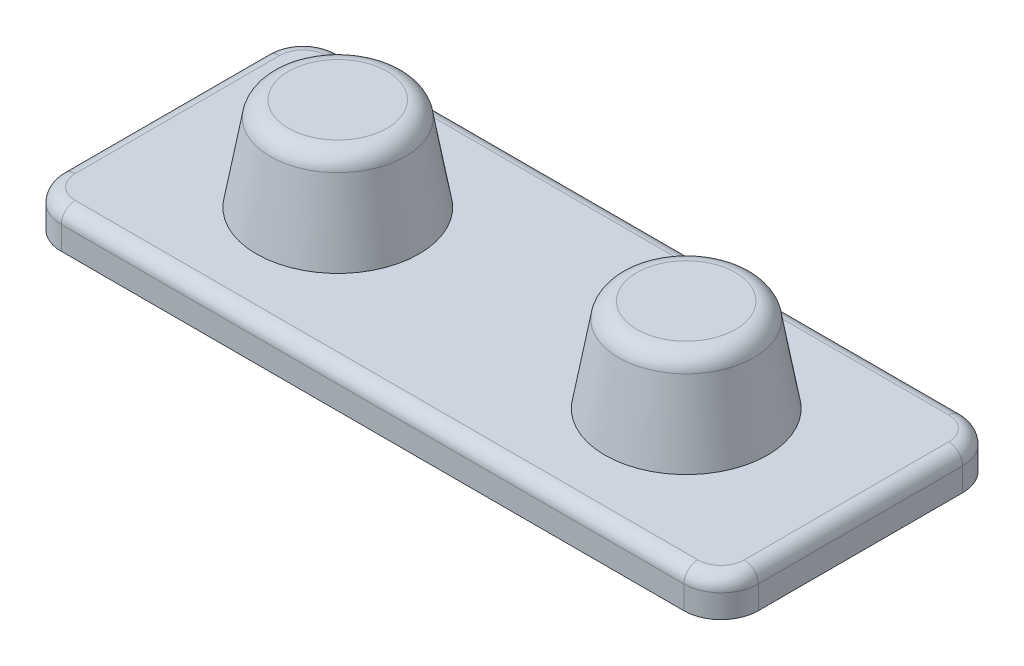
ISO-10303-21;
HEADER;
FILE_DESCRIPTION(('STEP AP214'),'2;1');
FILE_NAME('part.step','',(''),(''),'','','');
FILE_SCHEMA(('AUTOMOTIVE_DESIGN { 1 0 10303 214 1 1 1 1 }'));
ENDSEC;
DATA;
#1=APPLICATION_CONTEXT('core data for automotive mechanical design processes');
#2=APPLICATION_PROTOCOL_DEFINITION('international standard','automotive_design',2000,#1);
#3=PRODUCT_CONTEXT('',#1,'mechanical');
#4=PRODUCT('Part','Part','',(#3));
#5=PRODUCT_RELATED_PRODUCT_CATEGORY('part','',(#4));
#6=PRODUCT_DEFINITION_FORMATION('','',#4);
#7=PRODUCT_DEFINITION_CONTEXT('part definition',#1,'design');
#8=PRODUCT_DEFINITION('design','',#6,#7);
#9=PRODUCT_DEFINITION_SHAPE('','',#8);
#10=(LENGTH_UNIT() NAMED_UNIT(*) SI_UNIT(.MILLI.,.METRE.));
#11=(NAMED_UNIT(*) PLANE_ANGLE_UNIT() SI_UNIT($,.RADIAN.));
#12=(NAMED_UNIT(*) SI_UNIT($,.STERADIAN.) SOLID_ANGLE_UNIT());
#13=UNCERTAINTY_MEASURE_WITH_UNIT(LENGTH_MEASURE(1.E-05),#10,'distance_accuracy_value','');
#14=(GEOMETRIC_REPRESENTATION_CONTEXT(3) GLOBAL_UNCERTAINTY_ASSIGNED_CONTEXT((#13)) GLOBAL_UNIT_ASSIGNED_CONTEXT((#10,
#11,#12)) REPRESENTATION_CONTEXT('',''));
#15=CARTESIAN_POINT('',(0.,0.,0.));
#16=DIRECTION('',(0.,0.,1.));
#17=DIRECTION('',(1.,0.,0.));
#18=AXIS2_PLACEMENT_3D('',#15,#16,#17);
#19=CARTESIAN_POINT('',(73.,8.,30.));
#20=DIRECTION('',(-1.,0.,0.));
#21=DIRECTION('',(0.,0.,1.));
#22=AXIS2_PLACEMENT_3D('',#19,#20,#21);
#23=PLANE('',#22);
#24=DIRECTION('',(0.,0.,-1.));
#25=VECTOR('',#24,1.);
#26=CARTESIAN_POINT('',(73.,0.,30.));
#27=LINE('',#26,#25);
#28=CARTESIAN_POINT('',(73.,0.,-21.6506350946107));
#29=VERTEX_POINT('',#28);
#30=CARTESIAN_POINT('',(73.,0.,-22.));
#31=VERTEX_POINT('',#30);
#32=EDGE_CURVE('E589',#29,#31,#27,.T.);
#33=ORIENTED_EDGE('',*,*,#32,.F.);
#34=DIRECTION('',(0.,1.,0.));
#35=VECTOR('',#34,1.);
#36=CARTESIAN_POINT('',(73.,8.,-21.6506350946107));
#37=LINE('',#36,#35);
#38=CARTESIAN_POINT('',(73.,5.,-21.6506350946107));
#39=VERTEX_POINT('',#38);
#40=EDGE_CURVE('E1281',#29,#39,#37,.T.);
#41=ORIENTED_EDGE('',*,*,#40,.T.);
#42=DIRECTION('',(0.,0.,1.));
#43=VECTOR('',#42,1.);
#44=CARTESIAN_POINT('',(73.,5.,30.));
#45=LINE('',#44,#43);
#46=CARTESIAN_POINT('',(73.,5.,-22.));
#47=VERTEX_POINT('',#46);
#48=EDGE_CURVE('E490',#47,#39,#45,.T.);
#49=ORIENTED_EDGE('',*,*,#48,.F.);
#50=DIRECTION('',(0.,1.,0.));
#51=VECTOR('',#50,1.);
#52=CARTESIAN_POINT('',(73.,8.,-22.));
#53=LINE('',#52,#51);
#54=EDGE_CURVE('E486',#31,#47,#53,.T.);
#55=ORIENTED_EDGE('',*,*,#54,.F.);
#56=EDGE_LOOP('',(#33,#41,#49,#55));
#57=FACE_BOUND('',#56,.T.);
#58=ADVANCED_FACE('F49',(#57),#23,.T.);
#59=CARTESIAN_POINT('',(73.,5.,-19.3412340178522));
#60=VERTEX_POINT('',#59);
#61=CARTESIAN_POINT('',(73.,5.,19.3412340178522));
#62=VERTEX_POINT('',#61);
#63=EDGE_CURVE('E494',#60,#62,#45,.T.);
#64=ORIENTED_EDGE('',*,*,#63,.F.);
#65=DIRECTION('',(0.,-1.,0.));
#66=VECTOR('',#65,1.);
#67=CARTESIAN_POINT('',(73.,8.,-19.3412340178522));
#68=LINE('',#67,#66);
#69=CARTESIAN_POINT('',(73.,0.,-19.3412340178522));
#70=VERTEX_POINT('',#69);
#71=EDGE_CURVE('E1307',#60,#70,#68,.T.);
#72=ORIENTED_EDGE('',*,*,#71,.T.);
#73=CARTESIAN_POINT('',(73.,0.,19.3412340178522));
#74=VERTEX_POINT('',#73);
#75=EDGE_CURVE('E417',#74,#70,#27,.T.);
#76=ORIENTED_EDGE('',*,*,#75,.F.);
#77=DIRECTION('',(0.,-1.,0.));
#78=VECTOR('',#77,1.);
#79=CARTESIAN_POINT('',(73.,8.,19.3412340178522));
#80=LINE('',#79,#78);
#81=EDGE_CURVE('E863',#62,#74,#80,.T.);
#82=ORIENTED_EDGE('',*,*,#81,.F.);
#83=EDGE_LOOP('',(#64,#72,#76,#82));
#84=FACE_BOUND('',#83,.T.);
#85=ADVANCED_FACE('F1020',(#84),#23,.T.);
#86=CARTESIAN_POINT('',(72.,5.,0.));
#87=DIRECTION('',(0.,0.,1.));
#88=DIRECTION('',(1.,0.,0.));
#89=AXIS2_PLACEMENT_3D('',#86,#87,#88);
#90=CYLINDRICAL_SURFACE('',#89,1.);
#91=CARTESIAN_POINT('',(72.,5.,-21.0732848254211));
#92=DIRECTION('',(0.499999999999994,0.,0.866025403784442));
#93=DIRECTION('',(-0.866025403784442,0.,0.499999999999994));
#94=AXIS2_PLACEMENT_3D('',#91,#92,#93);
#95=ELLIPSE('',#94,1.15470053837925,1.);
#96=CARTESIAN_POINT('',(72.,6.,-21.0732848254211));
#97=VERTEX_POINT('',#96);
#98=EDGE_CURVE('E1283',#97,#39,#95,.F.);
#99=ORIENTED_EDGE('',*,*,#98,.F.);
#100=DIRECTION('',(0.,0.,1.));
#101=VECTOR('',#100,1.);
#102=CARTESIAN_POINT('',(72.,6.,0.));
#103=LINE('',#102,#101);
#104=CARTESIAN_POINT('',(72.,6.,-22.));
#105=VERTEX_POINT('',#104);
#106=EDGE_CURVE('E530',#97,#105,#103,.F.);
#107=ORIENTED_EDGE('',*,*,#106,.T.);
#108=CARTESIAN_POINT('',(72.,5.,-22.));
#109=DIRECTION('',(0.,0.,1.));
#110=DIRECTION('',(1.,0.,0.));
#111=AXIS2_PLACEMENT_3D('',#108,#109,#110);
#112=CIRCLE('',#111,1.);
#113=EDGE_CURVE('E553',#105,#47,#112,.F.);
#114=ORIENTED_EDGE('',*,*,#113,.T.);
#115=ORIENTED_EDGE('',*,*,#48,.T.);
#116=EDGE_LOOP('',(#99,#107,#114,#115));
#117=FACE_BOUND('',#116,.T.);
#118=ADVANCED_FACE('F1027',(#117),#90,.F.);
#119=CARTESIAN_POINT('',(72.,5.,-18.7638837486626));
#120=DIRECTION('',(-0.499999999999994,0.,-0.866025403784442));
#121=DIRECTION('',(-0.866025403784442,0.,0.499999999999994));
#122=AXIS2_PLACEMENT_3D('',#119,#120,#121);
#123=ELLIPSE('',#122,1.15470053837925,1.);
#124=CARTESIAN_POINT('',(72.,6.,-18.7638837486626));
#125=VERTEX_POINT('',#124);
#126=EDGE_CURVE('E1305',#60,#125,#123,.F.);
#127=ORIENTED_EDGE('',*,*,#126,.F.);
#128=ORIENTED_EDGE('',*,*,#63,.T.);
#129=CARTESIAN_POINT('',(72.,5.,18.7638837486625));
#130=DIRECTION('',(0.499999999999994,0.,-0.866025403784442));
#131=DIRECTION('',(0.866025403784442,0.,0.499999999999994));
#132=AXIS2_PLACEMENT_3D('',#129,#130,#131);
#133=ELLIPSE('',#132,1.15470053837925,1.);
#134=CARTESIAN_POINT('',(72.,6.,18.7638837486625));
#135=VERTEX_POINT('',#134);
#136=EDGE_CURVE('E730',#62,#135,#133,.F.);
#137=ORIENTED_EDGE('',*,*,#136,.T.);
#138=EDGE_CURVE('E529',#135,#125,#103,.F.);
#139=ORIENTED_EDGE('',*,*,#138,.T.);
#140=EDGE_LOOP('',(#127,#128,#137,#139));
#141=FACE_BOUND('',#140,.T.);
#142=ADVANCED_FACE('F1083',(#141),#90,.F.);
#143=CARTESIAN_POINT('',(0.,6.,0.));
#144=DIRECTION('',(0.,1.,0.));
#145=DIRECTION('',(0.,0.,1.));
#146=AXIS2_PLACEMENT_3D('',#143,#144,#145);
#147=PLANE('',#146);
#148=DIRECTION('',(-0.866025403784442,0.,0.499999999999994));
#149=VECTOR('',#148,1.);
#150=CARTESIAN_POINT('',(9.87499999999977,6.,17.1040017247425));
#151=LINE('',#150,#149);
#152=CARTESIAN_POINT('',(56.165902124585,6.,-9.62206307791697));
#153=VERTEX_POINT('',#152);
#154=EDGE_CURVE('E53',#125,#153,#151,.T.);
#155=ORIENTED_EDGE('',*,*,#154,.F.);
#156=ORIENTED_EDGE('',*,*,#138,.F.);
#157=DIRECTION('',(-0.866025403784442,0.,-0.499999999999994));
#158=VECTOR('',#157,1.);
#159=CARTESIAN_POINT('',(9.87499999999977,6.,-17.1040017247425));
#160=LINE('',#159,#158);
#161=CARTESIAN_POINT('',(56.165902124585,6.,9.62206307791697));
#162=VERTEX_POINT('',#161);
#163=EDGE_CURVE('E858',#135,#162,#160,.T.);
#164=ORIENTED_EDGE('',*,*,#163,.T.);
#165=CARTESIAN_POINT('',(37.5,6.,0.));
#166=DIRECTION('',(0.,1.,0.));
#167=DIRECTION('',(0.,0.,1.));
#168=AXIS2_PLACEMENT_3D('',#165,#166,#167);
#169=CIRCLE('',#168,21.);
#170=EDGE_CURVE('E718',#153,#162,#169,.F.);
#171=ORIENTED_EDGE('',*,*,#170,.F.);
#172=EDGE_LOOP('',(#155,#156,#164,#171));
#173=FACE_BOUND('',#172,.T.);
#174=ADVANCED_FACE('F859',(#173),#147,.F.);
#175=CARTESIAN_POINT('',(37.5,0.,0.));
#176=DIRECTION('',(0.,1.,0.));
#177=DIRECTION('',(0.,0.,1.));
#178=AXIS2_PLACEMENT_3D('',#175,#176,#177);
#179=CYLINDRICAL_SURFACE('',#178,21.);
#180=DIRECTION('',(0.,1.,0.));
#181=VECTOR('',#180,1.);
#182=CARTESIAN_POINT('',(56.165902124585,0.,-9.62206307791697));
#183=LINE('',#182,#181);
#184=CARTESIAN_POINT('',(56.165902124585,0.,-9.62206307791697));
#185=VERTEX_POINT('',#184);
#186=EDGE_CURVE('E422',#153,#185,#183,.F.);
#187=ORIENTED_EDGE('',*,*,#186,.F.);
#188=ORIENTED_EDGE('',*,*,#170,.T.);
#189=DIRECTION('',(0.,1.,0.));
#190=VECTOR('',#189,1.);
#191=CARTESIAN_POINT('',(56.165902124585,0.,9.62206307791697));
#192=LINE('',#191,#190);
#193=CARTESIAN_POINT('',(56.165902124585,0.,9.62206307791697));
#194=VERTEX_POINT('',#193);
#195=EDGE_CURVE('E432',#162,#194,#192,.F.);
#196=ORIENTED_EDGE('',*,*,#195,.T.);
#197=CARTESIAN_POINT('',(37.5,0.,0.));
#198=DIRECTION('',(0.,1.,0.));
#199=DIRECTION('',(0.,0.,1.));
#200=AXIS2_PLACEMENT_3D('',#197,#198,#199);
#201=CIRCLE('',#200,21.);
#202=EDGE_CURVE('E72',#185,#194,#201,.F.);
#203=ORIENTED_EDGE('',*,*,#202,.F.);
#204=EDGE_LOOP('',(#187,#188,#196,#203));
#205=FACE_BOUND('',#204,.T.);
#206=ADVANCED_FACE('F430',(#205),#179,.T.);
#207=DIRECTION('',(1.,0.,0.));
#208=VECTOR('',#207,1.);
#209=CARTESIAN_POINT('',(0.,6.,1.));
#210=LINE('',#209,#208);
#211=CARTESIAN_POINT('',(1.00000000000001,6.,1.));
#212=VERTEX_POINT('',#211);
#213=CARTESIAN_POINT('',(16.523823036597,6.,1.));
#214=VERTEX_POINT('',#213);
#215=EDGE_CURVE('E798',#212,#214,#210,.T.);
#216=ORIENTED_EDGE('',*,*,#215,.T.);
#217=CARTESIAN_POINT('',(55.165902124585,6.,11.3541138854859));
#218=VERTEX_POINT('',#217);
#219=EDGE_CURVE('E712',#218,#214,#169,.F.);
#220=ORIENTED_EDGE('',*,*,#219,.F.);
#221=DIRECTION('',(-0.866025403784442,0.,-0.499999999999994));
#222=VECTOR('',#221,1.);
#223=CARTESIAN_POINT('',(8.87499999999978,6.,-15.3719509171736));
#224=LINE('',#223,#222);
#225=CARTESIAN_POINT('',(72.,6.,21.073284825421));
#226=VERTEX_POINT('',#225);
#227=EDGE_CURVE('E738',#226,#218,#224,.T.);
#228=ORIENTED_EDGE('',*,*,#227,.F.);
#229=CARTESIAN_POINT('',(72.,6.,22.));
#230=VERTEX_POINT('',#229);
#231=EDGE_CURVE('E526',#230,#226,#103,.F.);
#232=ORIENTED_EDGE('',*,*,#231,.F.);
#233=CARTESIAN_POINT('',(67.,6.,22.));
#234=DIRECTION('',(0.,1.,0.));
#235=DIRECTION('',(0.,0.,1.));
#236=AXIS2_PLACEMENT_3D('',#233,#234,#235);
#237=CIRCLE('',#236,5.);
#238=CARTESIAN_POINT('',(67.,6.,27.));
#239=VERTEX_POINT('',#238);
#240=EDGE_CURVE('E544',#239,#230,#237,.T.);
#241=ORIENTED_EDGE('',*,*,#240,.F.);
#242=DIRECTION('',(1.,0.,0.));
#243=VECTOR('',#242,1.);
#244=CARTESIAN_POINT('',(0.,6.,27.));
#245=LINE('',#244,#243);
#246=CARTESIAN_POINT('',(1.,6.,27.));
#247=VERTEX_POINT('',#246);
#248=EDGE_CURVE('E518',#247,#239,#245,.T.);
#249=ORIENTED_EDGE('',*,*,#248,.F.);
#250=DIRECTION('',(0.,0.,-1.));
#251=VECTOR('',#250,1.);
#252=CARTESIAN_POINT('',(1.00000000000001,6.,0.));
#253=LINE('',#252,#251);
#254=EDGE_CURVE('E759',#247,#212,#253,.T.);
#255=ORIENTED_EDGE('',*,*,#254,.T.);
#256=EDGE_LOOP('',(#216,#220,#228,#232,#241,#249,#255));
#257=FACE_BOUND('',#256,.T.);
#258=ADVANCED_FACE('F748',(#257),#147,.F.);
#259=DIRECTION('',(0.,1.,0.));
#260=VECTOR('',#259,1.);
#261=CARTESIAN_POINT('',(16.523823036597,0.,1.));
#262=LINE('',#261,#260);
#263=CARTESIAN_POINT('',(16.523823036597,0.,1.));
#264=VERTEX_POINT('',#263);
#265=EDGE_CURVE('E795',#214,#264,#262,.F.);
#266=ORIENTED_EDGE('',*,*,#265,.T.);
#267=CARTESIAN_POINT('',(55.165902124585,0.,11.3541138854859));
#268=VERTEX_POINT('',#267);
#269=EDGE_CURVE('E434',#268,#264,#201,.F.);
#270=ORIENTED_EDGE('',*,*,#269,.F.);
#271=DIRECTION('',(0.,1.,0.));
#272=VECTOR('',#271,1.);
#273=CARTESIAN_POINT('',(55.165902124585,0.,11.3541138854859));
#274=LINE('',#273,#272);
#275=EDGE_CURVE('E854',#218,#268,#274,.F.);
#276=ORIENTED_EDGE('',*,*,#275,.F.);
#277=ORIENTED_EDGE('',*,*,#219,.T.);
#278=EDGE_LOOP('',(#266,#270,#276,#277));
#279=FACE_BOUND('',#278,.T.);
#280=ADVANCED_FACE('F853',(#279),#179,.T.);
#281=CARTESIAN_POINT('',(-73.,8.,30.));
#282=DIRECTION('',(1.,0.,0.));
#283=DIRECTION('',(0.,0.,-1.));
#284=AXIS2_PLACEMENT_3D('',#281,#282,#283);
#285=PLANE('',#284);
#286=DIRECTION('',(0.,-1.,0.));
#287=VECTOR('',#286,1.);
#288=CARTESIAN_POINT('',(-73.,8.,-19.3412340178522));
#289=LINE('',#288,#287);
#290=CARTESIAN_POINT('',(-73.,5.,-19.3412340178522));
#291=VERTEX_POINT('',#290);
#292=CARTESIAN_POINT('',(-73.,0.,-19.3412340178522));
#293=VERTEX_POINT('',#292);
#294=EDGE_CURVE('E897',#291,#293,#289,.T.);
#295=ORIENTED_EDGE('',*,*,#294,.F.);
#296=DIRECTION('',(0.,0.,-1.));
#297=VECTOR('',#296,1.);
#298=CARTESIAN_POINT('',(-73.,5.,30.));
#299=LINE('',#298,#297);
#300=CARTESIAN_POINT('',(-73.,5.,19.3412340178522));
#301=VERTEX_POINT('',#300);
#302=EDGE_CURVE('E465',#301,#291,#299,.T.);
#303=ORIENTED_EDGE('',*,*,#302,.F.);
#304=DIRECTION('',(0.,-1.,0.));
#305=VECTOR('',#304,1.);
#306=CARTESIAN_POINT('',(-73.,8.,19.3412340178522));
#307=LINE('',#306,#305);
#308=CARTESIAN_POINT('',(-73.,0.,19.3412340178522));
#309=VERTEX_POINT('',#308);
#310=EDGE_CURVE('E909',#301,#309,#307,.T.);
#311=ORIENTED_EDGE('',*,*,#310,.T.);
#312=DIRECTION('',(0.,0.,1.));
#313=VECTOR('',#312,1.);
#314=CARTESIAN_POINT('',(-73.,0.,30.));
#315=LINE('',#314,#313);
#316=EDGE_CURVE('E576',#293,#309,#315,.T.);
#317=ORIENTED_EDGE('',*,*,#316,.F.);
#318=EDGE_LOOP('',(#295,#303,#311,#317));
#319=FACE_BOUND('',#318,.T.);
#320=ADVANCED_FACE('F1243',(#319),#285,.T.);
#321=CARTESIAN_POINT('',(-72.,5.,0.));
#322=DIRECTION('',(0.,0.,-1.));
#323=DIRECTION('',(-1.,0.,0.));
#324=AXIS2_PLACEMENT_3D('',#321,#322,#323);
#325=CYLINDRICAL_SURFACE('',#324,1.);
#326=ORIENTED_EDGE('',*,*,#302,.T.);
#327=CARTESIAN_POINT('',(-72.,5.,-18.7638837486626));
#328=DIRECTION('',(-0.499999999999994,0.,0.866025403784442));
#329=DIRECTION('',(-0.866025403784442,0.,-0.499999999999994));
#330=AXIS2_PLACEMENT_3D('',#327,#328,#329);
#331=ELLIPSE('',#330,1.15470053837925,1.);
#332=CARTESIAN_POINT('',(-72.,6.,-18.7638837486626));
#333=VERTEX_POINT('',#332);
#334=EDGE_CURVE('E895',#291,#333,#331,.F.);
#335=ORIENTED_EDGE('',*,*,#334,.T.);
#336=DIRECTION('',(0.,0.,1.));
#337=VECTOR('',#336,1.);
#338=CARTESIAN_POINT('',(-72.,6.,0.));
#339=LINE('',#338,#337);
#340=CARTESIAN_POINT('',(-72.,6.,18.7638837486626));
#341=VERTEX_POINT('',#340);
#342=EDGE_CURVE('E541',#333,#341,#339,.T.);
#343=ORIENTED_EDGE('',*,*,#342,.T.);
#344=CARTESIAN_POINT('',(-72.,5.,18.7638837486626));
#345=DIRECTION('',(0.499999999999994,0.,0.866025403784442));
#346=DIRECTION('',(0.866025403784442,0.,-0.499999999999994));
#347=AXIS2_PLACEMENT_3D('',#344,#345,#346);
#348=ELLIPSE('',#347,1.15470053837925,1.);
#349=EDGE_CURVE('E721',#301,#341,#348,.F.);
#350=ORIENTED_EDGE('',*,*,#349,.F.);
#351=EDGE_LOOP('',(#326,#335,#343,#350));
#352=FACE_BOUND('',#351,.T.);
#353=ADVANCED_FACE('F1075',(#352),#325,.F.);
#354=CARTESIAN_POINT('',(-37.5,0.,0.));
#355=DIRECTION('',(0.,1.,0.));
#356=DIRECTION('',(0.,0.,1.));
#357=AXIS2_PLACEMENT_3D('',#354,#355,#356);
#358=CYLINDRICAL_SURFACE('',#357,21.);
#359=DIRECTION('',(0.,1.,0.));
#360=VECTOR('',#359,1.);
#361=CARTESIAN_POINT('',(-55.165902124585,0.,-11.3541138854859));
#362=LINE('',#361,#360);
#363=CARTESIAN_POINT('',(-55.165902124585,6.,-11.3541138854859));
#364=VERTEX_POINT('',#363);
#365=CARTESIAN_POINT('',(-55.165902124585,0.,-11.3541138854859));
#366=VERTEX_POINT('',#365);
#367=EDGE_CURVE('E877',#364,#366,#362,.F.);
#368=ORIENTED_EDGE('',*,*,#367,.F.);
#369=CARTESIAN_POINT('',(-37.5,6.,0.));
#370=DIRECTION('',(0.,1.,0.));
#371=DIRECTION('',(0.,0.,1.));
#372=AXIS2_PLACEMENT_3D('',#369,#370,#371);
#373=CIRCLE('',#372,21.);
#374=CARTESIAN_POINT('',(-16.523823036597,6.,-1.));
#375=VERTEX_POINT('',#374);
#376=EDGE_CURVE('E709',#364,#375,#373,.F.);
#377=ORIENTED_EDGE('',*,*,#376,.T.);
#378=DIRECTION('',(0.,1.,0.));
#379=VECTOR('',#378,1.);
#380=CARTESIAN_POINT('',(-16.523823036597,0.,-1.));
#381=LINE('',#380,#379);
#382=CARTESIAN_POINT('',(-16.523823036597,0.,-1.));
#383=VERTEX_POINT('',#382);
#384=EDGE_CURVE('E792',#383,#375,#381,.T.);
#385=ORIENTED_EDGE('',*,*,#384,.F.);
#386=CARTESIAN_POINT('',(-37.5,0.,0.));
#387=DIRECTION('',(0.,1.,0.));
#388=DIRECTION('',(0.,0.,1.));
#389=AXIS2_PLACEMENT_3D('',#386,#387,#388);
#390=CIRCLE('',#389,21.);
#391=EDGE_CURVE('E445',#366,#383,#390,.F.);
#392=ORIENTED_EDGE('',*,*,#391,.F.);
#393=EDGE_LOOP('',(#368,#377,#385,#392));
#394=FACE_BOUND('',#393,.T.);
#395=ADVANCED_FACE('F961',(#394),#358,.T.);
#396=DIRECTION('',(1.,0.,0.));
#397=VECTOR('',#396,1.);
#398=CARTESIAN_POINT('',(0.,6.,-27.));
#399=LINE('',#398,#397);
#400=CARTESIAN_POINT('',(-0.999999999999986,6.,-27.));
#401=VERTEX_POINT('',#400);
#402=CARTESIAN_POINT('',(-67.,6.,-27.));
#403=VERTEX_POINT('',#402);
#404=EDGE_CURVE('E501',#401,#403,#399,.F.);
#405=ORIENTED_EDGE('',*,*,#404,.F.);
#406=DIRECTION('',(0.,0.,-1.));
#407=VECTOR('',#406,1.);
#408=CARTESIAN_POINT('',(-0.999999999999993,6.,0.));
#409=LINE('',#408,#407);
#410=CARTESIAN_POINT('',(-0.999999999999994,6.,-1.));
#411=VERTEX_POINT('',#410);
#412=EDGE_CURVE('E833',#411,#401,#409,.T.);
#413=ORIENTED_EDGE('',*,*,#412,.F.);
#414=DIRECTION('',(1.,0.,0.));
#415=VECTOR('',#414,1.);
#416=CARTESIAN_POINT('',(0.,6.,-1.));
#417=LINE('',#416,#415);
#418=EDGE_CURVE('E789',#375,#411,#417,.T.);
#419=ORIENTED_EDGE('',*,*,#418,.F.);
#420=ORIENTED_EDGE('',*,*,#376,.F.);
#421=DIRECTION('',(0.866025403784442,0.,0.499999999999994));
#422=VECTOR('',#421,1.);
#423=CARTESIAN_POINT('',(-8.87499999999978,6.,15.3719509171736));
#424=LINE('',#423,#422);
#425=CARTESIAN_POINT('',(-72.,6.,-21.0732848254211));
#426=VERTEX_POINT('',#425);
#427=EDGE_CURVE('E888',#426,#364,#424,.T.);
#428=ORIENTED_EDGE('',*,*,#427,.F.);
#429=CARTESIAN_POINT('',(-72.,6.,-22.));
#430=VERTEX_POINT('',#429);
#431=EDGE_CURVE('E519',#430,#426,#339,.T.);
#432=ORIENTED_EDGE('',*,*,#431,.F.);
#433=CARTESIAN_POINT('',(-67.,6.,-22.));
#434=DIRECTION('',(0.,1.,0.));
#435=DIRECTION('',(0.,0.,1.));
#436=AXIS2_PLACEMENT_3D('',#433,#434,#435);
#437=CIRCLE('',#436,5.);
#438=EDGE_CURVE('E536',#403,#430,#437,.T.);
#439=ORIENTED_EDGE('',*,*,#438,.F.);
#440=EDGE_LOOP('',(#405,#413,#419,#420,#428,#432,#439));
#441=FACE_BOUND('',#440,.T.);
#442=ADVANCED_FACE('F941',(#441),#147,.F.);
#443=CARTESIAN_POINT('',(-16.523823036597,6.,1.));
#444=VERTEX_POINT('',#443);
#445=CARTESIAN_POINT('',(-0.999999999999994,6.,1.));
#446=VERTEX_POINT('',#445);
#447=EDGE_CURVE('E799',#444,#446,#210,.T.);
#448=ORIENTED_EDGE('',*,*,#447,.T.);
#449=CARTESIAN_POINT('',(-1.,6.,27.));
#450=VERTEX_POINT('',#449);
#451=EDGE_CURVE('E828',#450,#446,#409,.T.);
#452=ORIENTED_EDGE('',*,*,#451,.F.);
#453=CARTESIAN_POINT('',(-67.,6.,27.));
#454=VERTEX_POINT('',#453);
#455=EDGE_CURVE('E542',#454,#450,#245,.T.);
#456=ORIENTED_EDGE('',*,*,#455,.F.);
#457=CARTESIAN_POINT('',(-67.,6.,22.));
#458=DIRECTION('',(0.,1.,0.));
#459=DIRECTION('',(0.,0.,1.));
#460=AXIS2_PLACEMENT_3D('',#457,#458,#459);
#461=CIRCLE('',#460,5.);
#462=CARTESIAN_POINT('',(-72.,6.,22.));
#463=VERTEX_POINT('',#462);
#464=EDGE_CURVE('E516',#463,#454,#461,.T.);
#465=ORIENTED_EDGE('',*,*,#464,.F.);
#466=CARTESIAN_POINT('',(-72.,6.,21.0732848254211));
#467=VERTEX_POINT('',#466);
#468=EDGE_CURVE('E538',#467,#463,#339,.T.);
#469=ORIENTED_EDGE('',*,*,#468,.F.);
#470=DIRECTION('',(0.866025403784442,0.,-0.499999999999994));
#471=VECTOR('',#470,1.);
#472=CARTESIAN_POINT('',(-8.87499999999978,6.,-15.3719509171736));
#473=LINE('',#472,#471);
#474=CARTESIAN_POINT('',(-55.165902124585,6.,11.3541138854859));
#475=VERTEX_POINT('',#474);
#476=EDGE_CURVE('E914',#467,#475,#473,.T.);
#477=ORIENTED_EDGE('',*,*,#476,.T.);
#478=EDGE_CURVE('E710',#444,#475,#373,.F.);
#479=ORIENTED_EDGE('',*,*,#478,.F.);
#480=EDGE_LOOP('',(#448,#452,#456,#465,#469,#477,#479));
#481=FACE_BOUND('',#480,.T.);
#482=ADVANCED_FACE('F994',(#481),#147,.F.);
#483=CARTESIAN_POINT('',(-73.,0.,21.6506350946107));
#484=VERTEX_POINT('',#483);
#485=CARTESIAN_POINT('',(-73.,0.,22.));
#486=VERTEX_POINT('',#485);
#487=EDGE_CURVE('E515',#484,#486,#315,.T.);
#488=ORIENTED_EDGE('',*,*,#487,.F.);
#489=DIRECTION('',(0.,1.,0.));
#490=VECTOR('',#489,1.);
#491=CARTESIAN_POINT('',(-73.,8.,21.6506350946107));
#492=LINE('',#491,#490);
#493=CARTESIAN_POINT('',(-73.,5.,21.6506350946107));
#494=VERTEX_POINT('',#493);
#495=EDGE_CURVE('E916',#484,#494,#492,.T.);
#496=ORIENTED_EDGE('',*,*,#495,.T.);
#497=CARTESIAN_POINT('',(-73.,5.,22.));
#498=VERTEX_POINT('',#497);
#499=EDGE_CURVE('E461',#498,#494,#299,.T.);
#500=ORIENTED_EDGE('',*,*,#499,.F.);
#501=DIRECTION('',(0.,1.,0.));
#502=VECTOR('',#501,1.);
#503=CARTESIAN_POINT('',(-73.,8.,22.));
#504=LINE('',#503,#502);
#505=EDGE_CURVE('E456',#486,#498,#504,.T.);
#506=ORIENTED_EDGE('',*,*,#505,.F.);
#507=EDGE_LOOP('',(#488,#496,#500,#506));
#508=FACE_BOUND('',#507,.T.);
#509=ADVANCED_FACE('F1004',(#508),#285,.T.);
#510=DIRECTION('',(0.,1.,0.));
#511=VECTOR('',#510,1.);
#512=CARTESIAN_POINT('',(-73.,8.,-21.6506350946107));
#513=LINE('',#512,#511);
#514=CARTESIAN_POINT('',(-73.,0.,-21.6506350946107));
#515=VERTEX_POINT('',#514);
#516=CARTESIAN_POINT('',(-73.,5.,-21.6506350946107));
#517=VERTEX_POINT('',#516);
#518=EDGE_CURVE('E885',#515,#517,#513,.T.);
#519=ORIENTED_EDGE('',*,*,#518,.F.);
#520=CARTESIAN_POINT('',(-73.,0.,-22.));
#521=VERTEX_POINT('',#520);
#522=EDGE_CURVE('E572',#521,#515,#315,.T.);
#523=ORIENTED_EDGE('',*,*,#522,.F.);
#524=DIRECTION('',(0.,1.,0.));
#525=VECTOR('',#524,1.);
#526=CARTESIAN_POINT('',(-73.,8.,-22.));
#527=LINE('',#526,#525);
#528=CARTESIAN_POINT('',(-73.,5.,-22.));
#529=VERTEX_POINT('',#528);
#530=EDGE_CURVE('E459',#529,#521,#527,.F.);
#531=ORIENTED_EDGE('',*,*,#530,.F.);
#532=EDGE_CURVE('E466',#517,#529,#299,.T.);
#533=ORIENTED_EDGE('',*,*,#532,.F.);
#534=EDGE_LOOP('',(#519,#523,#531,#533));
#535=FACE_BOUND('',#534,.T.);
#536=ADVANCED_FACE('F1074',(#535),#285,.T.);
#537=ORIENTED_EDGE('',*,*,#499,.T.);
#538=CARTESIAN_POINT('',(-72.,5.,21.0732848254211));
#539=DIRECTION('',(0.499999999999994,0.,0.866025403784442));
#540=DIRECTION('',(0.866025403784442,0.,-0.499999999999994));
#541=AXIS2_PLACEMENT_3D('',#538,#539,#540);
#542=ELLIPSE('',#541,1.15470053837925,1.);
#543=EDGE_CURVE('E724',#494,#467,#542,.F.);
#544=ORIENTED_EDGE('',*,*,#543,.T.);
#545=ORIENTED_EDGE('',*,*,#468,.T.);
#546=CARTESIAN_POINT('',(-72.,5.,22.));
#547=DIRECTION('',(0.,0.,-1.));
#548=DIRECTION('',(-1.,0.,0.));
#549=AXIS2_PLACEMENT_3D('',#546,#547,#548);
#550=CIRCLE('',#549,1.);
#551=EDGE_CURVE('E508',#498,#463,#550,.T.);
#552=ORIENTED_EDGE('',*,*,#551,.F.);
#553=EDGE_LOOP('',(#537,#544,#545,#552));
#554=FACE_BOUND('',#553,.T.);
#555=ADVANCED_FACE('F990',(#554),#325,.F.);
#556=CARTESIAN_POINT('',(-72.,5.,-21.0732848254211));
#557=DIRECTION('',(-0.499999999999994,0.,0.866025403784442));
#558=DIRECTION('',(-0.866025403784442,0.,-0.499999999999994));
#559=AXIS2_PLACEMENT_3D('',#556,#557,#558);
#560=ELLIPSE('',#559,1.15470053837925,1.);
#561=EDGE_CURVE('E890',#517,#426,#560,.F.);
#562=ORIENTED_EDGE('',*,*,#561,.F.);
#563=ORIENTED_EDGE('',*,*,#532,.T.);
#564=CARTESIAN_POINT('',(-72.,5.,-22.));
#565=DIRECTION('',(0.,0.,-1.));
#566=DIRECTION('',(-1.,0.,0.));
#567=AXIS2_PLACEMENT_3D('',#564,#565,#566);
#568=CIRCLE('',#567,1.);
#569=EDGE_CURVE('E548',#529,#430,#568,.T.);
#570=ORIENTED_EDGE('',*,*,#569,.T.);
#571=ORIENTED_EDGE('',*,*,#431,.T.);
#572=EDGE_LOOP('',(#562,#563,#570,#571));
#573=FACE_BOUND('',#572,.T.);
#574=ADVANCED_FACE('F1073',(#573),#325,.F.);
#575=CARTESIAN_POINT('',(-56.165902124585,6.,9.62206307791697));
#576=VERTEX_POINT('',#575);
#577=CARTESIAN_POINT('',(-56.165902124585,6.,-9.62206307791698));
#578=VERTEX_POINT('',#577);
#579=EDGE_CURVE('E713',#576,#578,#373,.F.);
#580=ORIENTED_EDGE('',*,*,#579,.T.);
#581=DIRECTION('',(0.,1.,0.));
#582=VECTOR('',#581,1.);
#583=CARTESIAN_POINT('',(-56.165902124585,0.,-9.62206307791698));
#584=LINE('',#583,#582);
#585=CARTESIAN_POINT('',(-56.165902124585,0.,-9.62206307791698));
#586=VERTEX_POINT('',#585);
#587=EDGE_CURVE('E882',#578,#586,#584,.F.);
#588=ORIENTED_EDGE('',*,*,#587,.T.);
#589=CARTESIAN_POINT('',(-56.165902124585,0.,9.62206307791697));
#590=VERTEX_POINT('',#589);
#591=EDGE_CURVE('E452',#590,#586,#390,.F.);
#592=ORIENTED_EDGE('',*,*,#591,.F.);
#593=DIRECTION('',(0.,1.,0.));
#594=VECTOR('',#593,1.);
#595=CARTESIAN_POINT('',(-56.165902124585,0.,9.62206307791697));
#596=LINE('',#595,#594);
#597=EDGE_CURVE('E903',#576,#590,#596,.F.);
#598=ORIENTED_EDGE('',*,*,#597,.F.);
#599=EDGE_LOOP('',(#580,#588,#592,#598));
#600=FACE_BOUND('',#599,.T.);
#601=ADVANCED_FACE('F968',(#600),#358,.T.);
#602=CARTESIAN_POINT('',(75.,8.,28.));
#603=DIRECTION('',(0.,0.,-1.));
#604=DIRECTION('',(-1.,0.,0.));
#605=AXIS2_PLACEMENT_3D('',#602,#603,#604);
#606=PLANE('',#605);
#607=DIRECTION('',(0.,1.,0.));
#608=VECTOR('',#607,1.);
#609=CARTESIAN_POINT('',(-67.,8.,28.));
#610=LINE('',#609,#608);
#611=CARTESIAN_POINT('',(-67.,5.,28.));
#612=VERTEX_POINT('',#611);
#613=CARTESIAN_POINT('',(-67.,0.,28.));
#614=VERTEX_POINT('',#613);
#615=EDGE_CURVE('E489',#612,#614,#610,.F.);
#616=ORIENTED_EDGE('',*,*,#615,.F.);
#617=DIRECTION('',(-1.,0.,0.));
#618=VECTOR('',#617,1.);
#619=CARTESIAN_POINT('',(75.,5.,28.));
#620=LINE('',#619,#618);
#621=CARTESIAN_POINT('',(-1.,5.,28.));
#622=VERTEX_POINT('',#621);
#623=EDGE_CURVE('E497',#622,#612,#620,.T.);
#624=ORIENTED_EDGE('',*,*,#623,.F.);
#625=DIRECTION('',(0.,1.,0.));
#626=VECTOR('',#625,1.);
#627=CARTESIAN_POINT('',(-1.,0.,28.));
#628=LINE('',#627,#626);
#629=CARTESIAN_POINT('',(-1.,0.,28.));
#630=VERTEX_POINT('',#629);
#631=EDGE_CURVE('E925',#630,#622,#628,.T.);
#632=ORIENTED_EDGE('',*,*,#631,.F.);
#633=DIRECTION('',(1.,0.,0.));
#634=VECTOR('',#633,1.);
#635=CARTESIAN_POINT('',(75.,0.,28.));
#636=LINE('',#635,#634);
#637=EDGE_CURVE('E592',#614,#630,#636,.T.);
#638=ORIENTED_EDGE('',*,*,#637,.F.);
#639=EDGE_LOOP('',(#616,#624,#632,#638));
#640=FACE_BOUND('',#639,.T.);
#641=ADVANCED_FACE('F1044',(#640),#606,.T.);
#642=CARTESIAN_POINT('',(75.,8.,-28.));
#643=DIRECTION('',(0.,0.,1.));
#644=DIRECTION('',(1.,0.,0.));
#645=AXIS2_PLACEMENT_3D('',#642,#643,#644);
#646=PLANE('',#645);
#647=DIRECTION('',(0.,1.,0.));
#648=VECTOR('',#647,1.);
#649=CARTESIAN_POINT('',(-0.999999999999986,0.,-28.));
#650=LINE('',#649,#648);
#651=CARTESIAN_POINT('',(-0.999999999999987,0.,-28.));
#652=VERTEX_POINT('',#651);
#653=CARTESIAN_POINT('',(-0.999999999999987,5.,-28.));
#654=VERTEX_POINT('',#653);
#655=EDGE_CURVE('E919',#652,#654,#650,.T.);
#656=ORIENTED_EDGE('',*,*,#655,.T.);
#657=DIRECTION('',(1.,0.,0.));
#658=VECTOR('',#657,1.);
#659=CARTESIAN_POINT('',(75.,5.,-28.));
#660=LINE('',#659,#658);
#661=CARTESIAN_POINT('',(-67.,5.,-28.));
#662=VERTEX_POINT('',#661);
#663=EDGE_CURVE('E476',#662,#654,#660,.T.);
#664=ORIENTED_EDGE('',*,*,#663,.F.);
#665=DIRECTION('',(0.,1.,0.));
#666=VECTOR('',#665,1.);
#667=CARTESIAN_POINT('',(-67.,8.,-28.));
#668=LINE('',#667,#666);
#669=CARTESIAN_POINT('',(-67.,0.,-28.));
#670=VERTEX_POINT('',#669);
#671=EDGE_CURVE('E471',#670,#662,#668,.T.);
#672=ORIENTED_EDGE('',*,*,#671,.F.);
#673=DIRECTION('',(-1.,0.,0.));
#674=VECTOR('',#673,1.);
#675=CARTESIAN_POINT('',(75.,0.,-28.));
#676=LINE('',#675,#674);
#677=EDGE_CURVE('E582',#652,#670,#676,.T.);
#678=ORIENTED_EDGE('',*,*,#677,.F.);
#679=EDGE_LOOP('',(#656,#664,#672,#678));
#680=FACE_BOUND('',#679,.T.);
#681=ADVANCED_FACE('F949',(#680),#646,.T.);
#682=ORIENTED_EDGE('',*,*,#342,.F.);
#683=DIRECTION('',(0.866025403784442,0.,0.499999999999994));
#684=VECTOR('',#683,1.);
#685=CARTESIAN_POINT('',(-9.87499999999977,6.,17.1040017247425));
#686=LINE('',#685,#684);
#687=EDGE_CURVE('E893',#333,#578,#686,.T.);
#688=ORIENTED_EDGE('',*,*,#687,.T.);
#689=ORIENTED_EDGE('',*,*,#579,.F.);
#690=DIRECTION('',(0.866025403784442,0.,-0.499999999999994));
#691=VECTOR('',#690,1.);
#692=CARTESIAN_POINT('',(-9.87499999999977,6.,-17.1040017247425));
#693=LINE('',#692,#691);
#694=EDGE_CURVE('E912',#341,#576,#693,.T.);
#695=ORIENTED_EDGE('',*,*,#694,.F.);
#696=EDGE_LOOP('',(#682,#688,#689,#695));
#697=FACE_BOUND('',#696,.T.);
#698=ADVANCED_FACE('F984',(#697),#147,.F.);
#699=CARTESIAN_POINT('',(0.,5.,27.));
#700=DIRECTION('',(-1.,0.,0.));
#701=DIRECTION('',(0.,0.,1.));
#702=AXIS2_PLACEMENT_3D('',#699,#700,#701);
#703=CYLINDRICAL_SURFACE('',#702,1.);
#704=ORIENTED_EDGE('',*,*,#455,.T.);
#705=CARTESIAN_POINT('',(-1.,5.,27.));
#706=DIRECTION('',(1.,0.,0.));
#707=DIRECTION('',(0.,0.,-1.));
#708=AXIS2_PLACEMENT_3D('',#705,#706,#707);
#709=CIRCLE('',#708,1.);
#710=EDGE_CURVE('E831',#622,#450,#709,.F.);
#711=ORIENTED_EDGE('',*,*,#710,.F.);
#712=ORIENTED_EDGE('',*,*,#623,.T.);
#713=CARTESIAN_POINT('',(-67.,5.,27.));
#714=DIRECTION('',(-1.,0.,0.));
#715=DIRECTION('',(0.,0.,1.));
#716=AXIS2_PLACEMENT_3D('',#713,#714,#715);
#717=CIRCLE('',#716,1.);
#718=EDGE_CURVE('E511',#454,#612,#717,.F.);
#719=ORIENTED_EDGE('',*,*,#718,.F.);
#720=EDGE_LOOP('',(#704,#711,#712,#719));
#721=FACE_BOUND('',#720,.T.);
#722=ADVANCED_FACE('F1070',(#721),#703,.F.);
#723=CARTESIAN_POINT('',(0.,5.,-27.));
#724=DIRECTION('',(1.,0.,0.));
#725=DIRECTION('',(0.,0.,-1.));
#726=AXIS2_PLACEMENT_3D('',#723,#724,#725);
#727=CYLINDRICAL_SURFACE('',#726,1.);
#728=ORIENTED_EDGE('',*,*,#404,.T.);
#729=CARTESIAN_POINT('',(-67.,5.,-27.));
#730=DIRECTION('',(1.,0.,0.));
#731=DIRECTION('',(0.,0.,-1.));
#732=AXIS2_PLACEMENT_3D('',#729,#730,#731);
#733=CIRCLE('',#732,1.);
#734=EDGE_CURVE('E552',#662,#403,#733,.T.);
#735=ORIENTED_EDGE('',*,*,#734,.F.);
#736=ORIENTED_EDGE('',*,*,#663,.T.);
#737=CARTESIAN_POINT('',(-0.999999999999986,5.,-27.));
#738=DIRECTION('',(1.,0.,0.));
#739=DIRECTION('',(0.,0.,-1.));
#740=AXIS2_PLACEMENT_3D('',#737,#738,#739);
#741=CIRCLE('',#740,1.);
#742=EDGE_CURVE('E829',#401,#654,#741,.F.);
#743=ORIENTED_EDGE('',*,*,#742,.F.);
#744=EDGE_LOOP('',(#728,#735,#736,#743));
#745=FACE_BOUND('',#744,.T.);
#746=ADVANCED_FACE('F937',(#745),#727,.F.);
#747=CARTESIAN_POINT('',(-17.5,0.,1.));
#748=DIRECTION('',(0.,0.,1.));
#749=DIRECTION('',(1.,0.,0.));
#750=AXIS2_PLACEMENT_3D('',#747,#748,#749);
#751=PLANE('',#750);
#752=DIRECTION('',(1.,0.,0.));
#753=VECTOR('',#752,1.);
#754=CARTESIAN_POINT('',(-17.5,0.,1.));
#755=LINE('',#754,#753);
#756=CARTESIAN_POINT('',(-16.523823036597,0.,1.));
#757=VERTEX_POINT('',#756);
#758=CARTESIAN_POINT('',(-0.999999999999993,0.,1.));
#759=VERTEX_POINT('',#758);
#760=EDGE_CURVE('E780',#757,#759,#755,.T.);
#761=ORIENTED_EDGE('',*,*,#760,.T.);
#762=DIRECTION('',(0.,1.,0.));
#763=VECTOR('',#762,1.);
#764=CARTESIAN_POINT('',(-0.999999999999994,0.,1.));
#765=LINE('',#764,#763);
#766=EDGE_CURVE('E824',#759,#446,#765,.T.);
#767=ORIENTED_EDGE('',*,*,#766,.T.);
#768=ORIENTED_EDGE('',*,*,#447,.F.);
#769=DIRECTION('',(0.,1.,0.));
#770=VECTOR('',#769,1.);
#771=CARTESIAN_POINT('',(-16.523823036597,0.,1.));
#772=LINE('',#771,#770);
#773=EDGE_CURVE('E438',#757,#444,#772,.T.);
#774=ORIENTED_EDGE('',*,*,#773,.F.);
#775=EDGE_LOOP('',(#761,#767,#768,#774));
#776=FACE_BOUND('',#775,.T.);
#777=ADVANCED_FACE('F810',(#776),#751,.T.);
#778=CARTESIAN_POINT('',(-17.5,0.,-1.));
#779=DIRECTION('',(0.,0.,1.));
#780=DIRECTION('',(1.,0.,0.));
#781=AXIS2_PLACEMENT_3D('',#778,#779,#780);
#782=PLANE('',#781);
#783=DIRECTION('',(0.,1.,0.));
#784=VECTOR('',#783,1.);
#785=CARTESIAN_POINT('',(-0.999999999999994,0.,-1.));
#786=LINE('',#785,#784);
#787=CARTESIAN_POINT('',(-0.999999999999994,0.,-1.));
#788=VERTEX_POINT('',#787);
#789=EDGE_CURVE('E717',#788,#411,#786,.T.);
#790=ORIENTED_EDGE('',*,*,#789,.F.);
#791=DIRECTION('',(1.,0.,0.));
#792=VECTOR('',#791,1.);
#793=CARTESIAN_POINT('',(-17.5,0.,-1.));
#794=LINE('',#793,#792);
#795=EDGE_CURVE('E772',#383,#788,#794,.T.);
#796=ORIENTED_EDGE('',*,*,#795,.F.);
#797=ORIENTED_EDGE('',*,*,#384,.T.);
#798=ORIENTED_EDGE('',*,*,#418,.T.);
#799=EDGE_LOOP('',(#790,#796,#797,#798));
#800=FACE_BOUND('',#799,.T.);
#801=ADVANCED_FACE('F958',(#800),#782,.F.);
#802=CARTESIAN_POINT('',(0.,0.,0.));
#803=DIRECTION('',(0.,1.,0.));
#804=DIRECTION('',(0.,0.,1.));
#805=AXIS2_PLACEMENT_3D('',#802,#803,#804);
#806=PLANE('',#805);
#807=DIRECTION('',(-0.866025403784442,0.,0.499999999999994));
#808=VECTOR('',#807,1.);
#809=CARTESIAN_POINT('',(73.272879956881,0.,-19.4987813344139));
#810=LINE('',#809,#808);
#811=EDGE_CURVE('E412',#70,#185,#810,.T.);
#812=ORIENTED_EDGE('',*,*,#811,.T.);
#813=ORIENTED_EDGE('',*,*,#202,.T.);
#814=DIRECTION('',(-0.866025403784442,0.,-0.499999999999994));
#815=VECTOR('',#814,1.);
#816=CARTESIAN_POINT('',(56.1865334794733,0.,9.63397459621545));
#817=LINE('',#816,#815);
#818=EDGE_CURVE('E867',#74,#194,#817,.T.);
#819=ORIENTED_EDGE('',*,*,#818,.F.);
#820=ORIENTED_EDGE('',*,*,#75,.T.);
#821=EDGE_LOOP('',(#812,#813,#819,#820));
#822=FACE_BOUND('',#821,.T.);
#823=CARTESIAN_POINT('',(67.,0.,-22.));
#824=DIRECTION('',(0.,1.,0.));
#825=DIRECTION('',(0.,0.,1.));
#826=AXIS2_PLACEMENT_3D('',#823,#824,#825);
#827=CIRCLE('',#826,8.);
#828=CARTESIAN_POINT('',(67.,0.,-30.));
#829=VERTEX_POINT('',#828);
#830=CARTESIAN_POINT('',(75.,0.,-22.));
#831=VERTEX_POINT('',#830);
#832=EDGE_CURVE('E623',#829,#831,#827,.F.);
#833=ORIENTED_EDGE('',*,*,#832,.T.);
#834=DIRECTION('',(0.,0.,-1.));
#835=VECTOR('',#834,1.);
#836=CARTESIAN_POINT('',(75.,0.,30.));
#837=LINE('',#836,#835);
#838=CARTESIAN_POINT('',(75.,0.,22.));
#839=VERTEX_POINT('',#838);
#840=EDGE_CURVE('E607',#839,#831,#837,.T.);
#841=ORIENTED_EDGE('',*,*,#840,.F.);
#842=CARTESIAN_POINT('',(67.,0.,22.));
#843=DIRECTION('',(0.,1.,0.));
#844=DIRECTION('',(0.,0.,1.));
#845=AXIS2_PLACEMENT_3D('',#842,#843,#844);
#846=CIRCLE('',#845,8.);
#847=CARTESIAN_POINT('',(67.,0.,30.));
#848=VERTEX_POINT('',#847);
#849=EDGE_CURVE('E620',#839,#848,#846,.F.);
#850=ORIENTED_EDGE('',*,*,#849,.T.);
#851=DIRECTION('',(1.,0.,0.));
#852=VECTOR('',#851,1.);
#853=CARTESIAN_POINT('',(75.,0.,30.));
#854=LINE('',#853,#852);
#855=CARTESIAN_POINT('',(-67.,0.,30.));
#856=VERTEX_POINT('',#855);
#857=EDGE_CURVE('E604',#856,#848,#854,.T.);
#858=ORIENTED_EDGE('',*,*,#857,.F.);
#859=CARTESIAN_POINT('',(-67.,0.,22.));
#860=DIRECTION('',(0.,1.,0.));
#861=DIRECTION('',(0.,0.,1.));
#862=AXIS2_PLACEMENT_3D('',#859,#860,#861);
#863=CIRCLE('',#862,8.);
#864=CARTESIAN_POINT('',(-75.,0.,22.));
#865=VERTEX_POINT('',#864);
#866=EDGE_CURVE('E617',#856,#865,#863,.F.);
#867=ORIENTED_EDGE('',*,*,#866,.T.);
#868=DIRECTION('',(0.,0.,1.));
#869=VECTOR('',#868,1.);
#870=CARTESIAN_POINT('',(-75.,0.,30.));
#871=LINE('',#870,#869);
#872=CARTESIAN_POINT('',(-75.,0.,-22.));
#873=VERTEX_POINT('',#872);
#874=EDGE_CURVE('E602',#873,#865,#871,.T.);
#875=ORIENTED_EDGE('',*,*,#874,.F.);
#876=CARTESIAN_POINT('',(-67.,0.,-22.));
#877=DIRECTION('',(0.,1.,0.));
#878=DIRECTION('',(0.,0.,1.));
#879=AXIS2_PLACEMENT_3D('',#876,#877,#878);
#880=CIRCLE('',#879,8.);
#881=CARTESIAN_POINT('',(-67.,0.,-30.));
#882=VERTEX_POINT('',#881);
#883=EDGE_CURVE('E625',#873,#882,#880,.F.);
#884=ORIENTED_EDGE('',*,*,#883,.T.);
#885=DIRECTION('',(-1.,0.,0.));
#886=VECTOR('',#885,1.);
#887=CARTESIAN_POINT('',(75.,0.,-30.));
#888=LINE('',#887,#886);
#889=EDGE_CURVE('E610',#829,#882,#888,.T.);
#890=ORIENTED_EDGE('',*,*,#889,.F.);
#891=EDGE_LOOP('',(#833,#841,#850,#858,#867,#875,#884,#890));
#892=FACE_BOUND('',#891,.T.);
#893=CARTESIAN_POINT('',(37.5,0.,0.));
#894=DIRECTION('',(0.,1.,0.));
#895=DIRECTION('',(0.,0.,1.));
#896=AXIS2_PLACEMENT_3D('',#893,#894,#895);
#897=CIRCLE('',#896,19.);
#898=CARTESIAN_POINT('',(37.5,0.,19.));
#899=VERTEX_POINT('',#898);
#900=EDGE_CURVE('E437',#899,#899,#897,.F.);
#901=ORIENTED_EDGE('',*,*,#900,.F.);
#902=EDGE_LOOP('',(#901));
#903=FACE_BOUND('',#902,.T.);
#904=ORIENTED_EDGE('',*,*,#269,.T.);
#905=CARTESIAN_POINT('',(1.00000000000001,0.,1.));
#906=VERTEX_POINT('',#905);
#907=EDGE_CURVE('E783',#906,#264,#755,.T.);
#908=ORIENTED_EDGE('',*,*,#907,.F.);
#909=DIRECTION('',(0.,0.,-1.));
#910=VECTOR('',#909,1.);
#911=CARTESIAN_POINT('',(1.,0.,28.));
#912=LINE('',#911,#910);
#913=CARTESIAN_POINT('',(1.,0.,28.));
#914=VERTEX_POINT('',#913);
#915=EDGE_CURVE('E845',#914,#906,#912,.T.);
#916=ORIENTED_EDGE('',*,*,#915,.F.);
#917=CARTESIAN_POINT('',(67.,0.,28.));
#918=VERTEX_POINT('',#917);
#919=EDGE_CURVE('E575',#914,#918,#636,.T.);
#920=ORIENTED_EDGE('',*,*,#919,.T.);
#921=CARTESIAN_POINT('',(67.,0.,22.));
#922=DIRECTION('',(0.,1.,0.));
#923=DIRECTION('',(0.,0.,1.));
#924=AXIS2_PLACEMENT_3D('',#921,#922,#923);
#925=CIRCLE('',#924,6.);
#926=CARTESIAN_POINT('',(73.,0.,22.));
#927=VERTEX_POINT('',#926);
#928=EDGE_CURVE('E585',#927,#918,#925,.F.);
#929=ORIENTED_EDGE('',*,*,#928,.F.);
#930=CARTESIAN_POINT('',(73.,0.,21.6506350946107));
#931=VERTEX_POINT('',#930);
#932=EDGE_CURVE('E586',#927,#931,#27,.T.);
#933=ORIENTED_EDGE('',*,*,#932,.T.);
#934=DIRECTION('',(-0.866025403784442,0.,-0.499999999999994));
#935=VECTOR('',#934,1.);
#936=CARTESIAN_POINT('',(72.272879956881,0.,21.2308321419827));
#937=LINE('',#936,#935);
#938=EDGE_CURVE('E1048',#931,#268,#937,.T.);
#939=ORIENTED_EDGE('',*,*,#938,.T.);
#940=EDGE_LOOP('',(#904,#908,#916,#920,#929,#933,#939));
#941=FACE_BOUND('',#940,.T.);
#942=DIRECTION('',(0.,0.,-1.));
#943=VECTOR('',#942,1.);
#944=CARTESIAN_POINT('',(-1.,0.,28.));
#945=LINE('',#944,#943);
#946=EDGE_CURVE('E816',#630,#759,#945,.T.);
#947=ORIENTED_EDGE('',*,*,#946,.T.);
#948=ORIENTED_EDGE('',*,*,#760,.F.);
#949=CARTESIAN_POINT('',(-55.165902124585,0.,11.3541138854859));
#950=VERTEX_POINT('',#949);
#951=EDGE_CURVE('E450',#757,#950,#390,.F.);
#952=ORIENTED_EDGE('',*,*,#951,.T.);
#953=DIRECTION('',(0.866025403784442,0.,-0.499999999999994));
#954=VECTOR('',#953,1.);
#955=CARTESIAN_POINT('',(-72.272879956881,0.,21.2308321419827));
#956=LINE('',#955,#954);
#957=EDGE_CURVE('E901',#484,#950,#956,.T.);
#958=ORIENTED_EDGE('',*,*,#957,.F.);
#959=ORIENTED_EDGE('',*,*,#487,.T.);
#960=CARTESIAN_POINT('',(-67.,0.,22.));
#961=DIRECTION('',(0.,1.,0.));
#962=DIRECTION('',(0.,0.,1.));
#963=AXIS2_PLACEMENT_3D('',#960,#961,#962);
#964=CIRCLE('',#963,6.);
#965=EDGE_CURVE('E468',#614,#486,#964,.F.);
#966=ORIENTED_EDGE('',*,*,#965,.F.);
#967=ORIENTED_EDGE('',*,*,#637,.T.);
#968=EDGE_LOOP('',(#947,#948,#952,#958,#959,#966,#967));
#969=FACE_BOUND('',#968,.T.);
#970=CARTESIAN_POINT('',(16.523823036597,0.,-1.));
#971=VERTEX_POINT('',#970);
#972=CARTESIAN_POINT('',(55.165902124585,0.,-11.3541138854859));
#973=VERTEX_POINT('',#972);
#974=EDGE_CURVE('E433',#971,#973,#201,.F.);
#975=ORIENTED_EDGE('',*,*,#974,.T.);
#976=DIRECTION('',(-0.866025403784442,0.,0.499999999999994));
#977=VECTOR('',#976,1.);
#978=CARTESIAN_POINT('',(72.272879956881,0.,-21.2308321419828));
#979=LINE('',#978,#977);
#980=EDGE_CURVE('E64',#29,#973,#979,.T.);
#981=ORIENTED_EDGE('',*,*,#980,.F.);
#982=ORIENTED_EDGE('',*,*,#32,.T.);
#983=CARTESIAN_POINT('',(67.,0.,-22.));
#984=DIRECTION('',(0.,1.,0.));
#985=DIRECTION('',(0.,0.,1.));
#986=AXIS2_PLACEMENT_3D('',#983,#984,#985);
#987=CIRCLE('',#986,6.);
#988=CARTESIAN_POINT('',(67.,0.,-28.));
#989=VERTEX_POINT('',#988);
#990=EDGE_CURVE('E579',#989,#31,#987,.F.);
#991=ORIENTED_EDGE('',*,*,#990,.F.);
#992=CARTESIAN_POINT('',(1.00000000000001,0.,-28.));
#993=VERTEX_POINT('',#992);
#994=EDGE_CURVE('E460',#989,#993,#676,.T.);
#995=ORIENTED_EDGE('',*,*,#994,.T.);
#996=CARTESIAN_POINT('',(1.00000000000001,0.,-1.));
#997=VERTEX_POINT('',#996);
#998=EDGE_CURVE('E922',#997,#993,#912,.T.);
#999=ORIENTED_EDGE('',*,*,#998,.F.);
#1000=EDGE_CURVE('E770',#997,#971,#794,.T.);
#1001=ORIENTED_EDGE('',*,*,#1000,.T.);
#1002=EDGE_LOOP('',(#975,#981,#982,#991,#995,#999,#1001));
#1003=FACE_BOUND('',#1002,.T.);
#1004=EDGE_CURVE('E822',#788,#652,#945,.T.);
#1005=ORIENTED_EDGE('',*,*,#1004,.T.);
#1006=ORIENTED_EDGE('',*,*,#677,.T.);
#1007=CARTESIAN_POINT('',(-67.,0.,-22.));
#1008=DIRECTION('',(0.,1.,0.));
#1009=DIRECTION('',(0.,0.,1.));
#1010=AXIS2_PLACEMENT_3D('',#1007,#1008,#1009);
#1011=CIRCLE('',#1010,6.);
#1012=EDGE_CURVE('E480',#521,#670,#1011,.F.);
#1013=ORIENTED_EDGE('',*,*,#1012,.F.);
#1014=ORIENTED_EDGE('',*,*,#522,.T.);
#1015=DIRECTION('',(-0.866025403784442,0.,-0.499999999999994));
#1016=VECTOR('',#1015,1.);
#1017=CARTESIAN_POINT('',(-72.272879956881,0.,-21.2308321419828));
#1018=LINE('',#1017,#1016);
#1019=EDGE_CURVE('E874',#366,#515,#1018,.T.);
#1020=ORIENTED_EDGE('',*,*,#1019,.F.);
#1021=ORIENTED_EDGE('',*,*,#391,.T.);
#1022=ORIENTED_EDGE('',*,*,#795,.T.);
#1023=EDGE_LOOP('',(#1005,#1006,#1013,#1014,#1020,#1021,#1022));
#1024=FACE_BOUND('',#1023,.T.);
#1025=CARTESIAN_POINT('',(-37.5,0.,0.));
#1026=DIRECTION('',(0.,1.,0.));
#1027=DIRECTION('',(0.,0.,1.));
#1028=AXIS2_PLACEMENT_3D('',#1025,#1026,#1027);
#1029=CIRCLE('',#1028,19.);
#1030=CARTESIAN_POINT('',(-37.5,0.,19.));
#1031=VERTEX_POINT('',#1030);
#1032=EDGE_CURVE('E446',#1031,#1031,#1029,.F.);
#1033=ORIENTED_EDGE('',*,*,#1032,.F.);
#1034=EDGE_LOOP('',(#1033));
#1035=FACE_BOUND('',#1034,.T.);
#1036=ORIENTED_EDGE('',*,*,#591,.T.);
#1037=DIRECTION('',(0.866025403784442,0.,0.499999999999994));
#1038=VECTOR('',#1037,1.);
#1039=CARTESIAN_POINT('',(-73.272879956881,0.,-19.4987813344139));
#1040=LINE('',#1039,#1038);
#1041=EDGE_CURVE('E875',#293,#586,#1040,.T.);
#1042=ORIENTED_EDGE('',*,*,#1041,.F.);
#1043=ORIENTED_EDGE('',*,*,#316,.T.);
#1044=DIRECTION('',(0.866025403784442,0.,-0.499999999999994));
#1045=VECTOR('',#1044,1.);
#1046=CARTESIAN_POINT('',(-73.272879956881,0.,19.4987813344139));
#1047=LINE('',#1046,#1045);
#1048=EDGE_CURVE('E900',#309,#590,#1047,.T.);
#1049=ORIENTED_EDGE('',*,*,#1048,.T.);
#1050=EDGE_LOOP('',(#1036,#1042,#1043,#1049));
#1051=FACE_BOUND('',#1050,.T.);
#1052=ADVANCED_FACE('F414',(#822,#892,#903,#941,#969,#1003,#1024,#1035,#1051),#806,.F.);
#1053=CARTESIAN_POINT('',(-75.,8.,30.));
#1054=DIRECTION('',(1.,0.,0.));
#1055=DIRECTION('',(0.,0.,-1.));
#1056=AXIS2_PLACEMENT_3D('',#1053,#1054,#1055);
#1057=PLANE('',#1056);
#1058=ORIENTED_EDGE('',*,*,#874,.T.);
#1059=DIRECTION('',(0.,-1.,0.));
#1060=VECTOR('',#1059,1.);
#1061=CARTESIAN_POINT('',(-75.,8.,22.));
#1062=LINE('',#1061,#1060);
#1063=CARTESIAN_POINT('',(-75.,5.,22.));
#1064=VERTEX_POINT('',#1063);
#1065=EDGE_CURVE('E612',#865,#1064,#1062,.F.);
#1066=ORIENTED_EDGE('',*,*,#1065,.T.);
#1067=DIRECTION('',(0.,0.,1.));
#1068=VECTOR('',#1067,1.);
#1069=CARTESIAN_POINT('',(-75.,5.,-22.));
#1070=LINE('',#1069,#1068);
#1071=CARTESIAN_POINT('',(-75.,5.,-22.));
#1072=VERTEX_POINT('',#1071);
#1073=EDGE_CURVE('E671',#1064,#1072,#1070,.F.);
#1074=ORIENTED_EDGE('',*,*,#1073,.T.);
#1075=DIRECTION('',(0.,-1.,0.));
#1076=VECTOR('',#1075,1.);
#1077=CARTESIAN_POINT('',(-75.,8.,-22.));
#1078=LINE('',#1077,#1076);
#1079=EDGE_CURVE('E615',#1072,#873,#1078,.T.);
#1080=ORIENTED_EDGE('',*,*,#1079,.T.);
#1081=EDGE_LOOP('',(#1058,#1066,#1074,#1080));
#1082=FACE_BOUND('',#1081,.T.);
#1083=ADVANCED_FACE('F1120',(#1082),#1057,.F.);
#1084=CARTESIAN_POINT('',(75.,8.,30.));
#1085=DIRECTION('',(0.,0.,-1.));
#1086=DIRECTION('',(-1.,0.,0.));
#1087=AXIS2_PLACEMENT_3D('',#1084,#1085,#1086);
#1088=PLANE('',#1087);
#1089=ORIENTED_EDGE('',*,*,#857,.T.);
#1090=DIRECTION('',(0.,-1.,0.));
#1091=VECTOR('',#1090,1.);
#1092=CARTESIAN_POINT('',(67.,8.,30.));
#1093=LINE('',#1092,#1091);
#1094=CARTESIAN_POINT('',(67.,5.,30.));
#1095=VERTEX_POINT('',#1094);
#1096=EDGE_CURVE('E640',#848,#1095,#1093,.F.);
#1097=ORIENTED_EDGE('',*,*,#1096,.T.);
#1098=DIRECTION('',(1.,0.,0.));
#1099=VECTOR('',#1098,1.);
#1100=CARTESIAN_POINT('',(-67.,5.,30.));
#1101=LINE('',#1100,#1099);
#1102=CARTESIAN_POINT('',(-67.,5.,30.));
#1103=VERTEX_POINT('',#1102);
#1104=EDGE_CURVE('E667',#1095,#1103,#1101,.F.);
#1105=ORIENTED_EDGE('',*,*,#1104,.T.);
#1106=DIRECTION('',(0.,-1.,0.));
#1107=VECTOR('',#1106,1.);
#1108=CARTESIAN_POINT('',(-67.,8.,30.));
#1109=LINE('',#1108,#1107);
#1110=EDGE_CURVE('E638',#1103,#856,#1109,.T.);
#1111=ORIENTED_EDGE('',*,*,#1110,.T.);
#1112=EDGE_LOOP('',(#1089,#1097,#1105,#1111));
#1113=FACE_BOUND('',#1112,.T.);
#1114=ADVANCED_FACE('F1127',(#1113),#1088,.F.);
#1115=CARTESIAN_POINT('',(75.,8.,30.));
#1116=DIRECTION('',(-1.,0.,0.));
#1117=DIRECTION('',(0.,0.,1.));
#1118=AXIS2_PLACEMENT_3D('',#1115,#1116,#1117);
#1119=PLANE('',#1118);
#1120=ORIENTED_EDGE('',*,*,#840,.T.);
#1121=DIRECTION('',(0.,-1.,0.));
#1122=VECTOR('',#1121,1.);
#1123=CARTESIAN_POINT('',(75.,8.,-22.));
#1124=LINE('',#1123,#1122);
#1125=CARTESIAN_POINT('',(75.,5.,-22.));
#1126=VERTEX_POINT('',#1125);
#1127=EDGE_CURVE('E635',#831,#1126,#1124,.F.);
#1128=ORIENTED_EDGE('',*,*,#1127,.T.);
#1129=DIRECTION('',(0.,0.,-1.));
#1130=VECTOR('',#1129,1.);
#1131=CARTESIAN_POINT('',(75.,5.,22.));
#1132=LINE('',#1131,#1130);
#1133=CARTESIAN_POINT('',(75.,5.,22.));
#1134=VERTEX_POINT('',#1133);
#1135=EDGE_CURVE('E663',#1126,#1134,#1132,.F.);
#1136=ORIENTED_EDGE('',*,*,#1135,.T.);
#1137=DIRECTION('',(0.,-1.,0.));
#1138=VECTOR('',#1137,1.);
#1139=CARTESIAN_POINT('',(75.,8.,22.));
#1140=LINE('',#1139,#1138);
#1141=EDGE_CURVE('E633',#1134,#839,#1140,.T.);
#1142=ORIENTED_EDGE('',*,*,#1141,.T.);
#1143=EDGE_LOOP('',(#1120,#1128,#1136,#1142));
#1144=FACE_BOUND('',#1143,.T.);
#1145=ADVANCED_FACE('F1123',(#1144),#1119,.F.);
#1146=CARTESIAN_POINT('',(75.,8.,-30.));
#1147=DIRECTION('',(0.,0.,1.));
#1148=DIRECTION('',(1.,0.,0.));
#1149=AXIS2_PLACEMENT_3D('',#1146,#1147,#1148);
#1150=PLANE('',#1149);
#1151=ORIENTED_EDGE('',*,*,#889,.T.);
#1152=DIRECTION('',(0.,-1.,0.));
#1153=VECTOR('',#1152,1.);
#1154=CARTESIAN_POINT('',(-67.,8.,-30.));
#1155=LINE('',#1154,#1153);
#1156=CARTESIAN_POINT('',(-67.,5.,-30.));
#1157=VERTEX_POINT('',#1156);
#1158=EDGE_CURVE('E630',#882,#1157,#1155,.F.);
#1159=ORIENTED_EDGE('',*,*,#1158,.T.);
#1160=DIRECTION('',(-1.,0.,0.));
#1161=VECTOR('',#1160,1.);
#1162=CARTESIAN_POINT('',(67.,5.,-30.));
#1163=LINE('',#1162,#1161);
#1164=CARTESIAN_POINT('',(67.,5.,-30.));
#1165=VERTEX_POINT('',#1164);
#1166=EDGE_CURVE('E675',#1157,#1165,#1163,.F.);
#1167=ORIENTED_EDGE('',*,*,#1166,.T.);
#1168=DIRECTION('',(0.,-1.,0.));
#1169=VECTOR('',#1168,1.);
#1170=CARTESIAN_POINT('',(67.,8.,-30.));
#1171=LINE('',#1170,#1169);
#1172=EDGE_CURVE('E628',#1165,#829,#1171,.T.);
#1173=ORIENTED_EDGE('',*,*,#1172,.T.);
#1174=EDGE_LOOP('',(#1151,#1159,#1167,#1173));
#1175=FACE_BOUND('',#1174,.T.);
#1176=ADVANCED_FACE('F1116',(#1175),#1150,.F.);
#1177=CARTESIAN_POINT('',(0.,8.,0.));
#1178=DIRECTION('',(0.,1.,0.));
#1179=DIRECTION('',(0.,0.,1.));
#1180=AXIS2_PLACEMENT_3D('',#1177,#1178,#1179);
#1181=PLANE('',#1180);
#1182=CARTESIAN_POINT('',(37.5,8.,0.));
#1183=DIRECTION('',(0.,1.,0.));
#1184=DIRECTION('',(0.,0.,1.));
#1185=AXIS2_PLACEMENT_3D('',#1182,#1183,#1184);
#1186=CIRCLE('',#1185,17.5);
#1187=CARTESIAN_POINT('',(37.5,8.,17.5));
#1188=VERTEX_POINT('',#1187);
#1189=EDGE_CURVE('E563',#1188,#1188,#1186,.T.);
#1190=ORIENTED_EDGE('',*,*,#1189,.F.);
#1191=EDGE_LOOP('',(#1190));
#1192=FACE_BOUND('',#1191,.T.);
#1193=DIRECTION('',(0.,0.,-1.));
#1194=VECTOR('',#1193,1.);
#1195=CARTESIAN_POINT('',(72.,8.,-22.));
#1196=LINE('',#1195,#1194);
#1197=CARTESIAN_POINT('',(72.,8.,22.));
#1198=VERTEX_POINT('',#1197);
#1199=CARTESIAN_POINT('',(72.,8.,-22.));
#1200=VERTEX_POINT('',#1199);
#1201=EDGE_CURVE('E656',#1198,#1200,#1196,.T.);
#1202=ORIENTED_EDGE('',*,*,#1201,.T.);
#1203=CARTESIAN_POINT('',(67.,8.,-22.));
#1204=DIRECTION('',(0.,1.,0.));
#1205=DIRECTION('',(0.,0.,1.));
#1206=AXIS2_PLACEMENT_3D('',#1203,#1204,#1205);
#1207=CIRCLE('',#1206,5.);
#1208=CARTESIAN_POINT('',(67.,8.,-27.));
#1209=VERTEX_POINT('',#1208);
#1210=EDGE_CURVE('E658',#1200,#1209,#1207,.T.);
#1211=ORIENTED_EDGE('',*,*,#1210,.T.);
#1212=DIRECTION('',(-1.,0.,0.));
#1213=VECTOR('',#1212,1.);
#1214=CARTESIAN_POINT('',(-67.,8.,-27.));
#1215=LINE('',#1214,#1213);
#1216=CARTESIAN_POINT('',(-67.,8.,-27.));
#1217=VERTEX_POINT('',#1216);
#1218=EDGE_CURVE('E643',#1209,#1217,#1215,.T.);
#1219=ORIENTED_EDGE('',*,*,#1218,.T.);
#1220=CARTESIAN_POINT('',(-67.,8.,-22.));
#1221=DIRECTION('',(0.,1.,0.));
#1222=DIRECTION('',(0.,0.,1.));
#1223=AXIS2_PLACEMENT_3D('',#1220,#1221,#1222);
#1224=CIRCLE('',#1223,5.);
#1225=CARTESIAN_POINT('',(-72.,8.,-22.));
#1226=VERTEX_POINT('',#1225);
#1227=EDGE_CURVE('E645',#1217,#1226,#1224,.T.);
#1228=ORIENTED_EDGE('',*,*,#1227,.T.);
#1229=DIRECTION('',(0.,0.,1.));
#1230=VECTOR('',#1229,1.);
#1231=CARTESIAN_POINT('',(-72.,8.,22.));
#1232=LINE('',#1231,#1230);
#1233=CARTESIAN_POINT('',(-72.,8.,22.));
#1234=VERTEX_POINT('',#1233);
#1235=EDGE_CURVE('E648',#1226,#1234,#1232,.T.);
#1236=ORIENTED_EDGE('',*,*,#1235,.T.);
#1237=CARTESIAN_POINT('',(-67.,8.,22.));
#1238=DIRECTION('',(0.,1.,0.));
#1239=DIRECTION('',(0.,0.,1.));
#1240=AXIS2_PLACEMENT_3D('',#1237,#1238,#1239);
#1241=CIRCLE('',#1240,5.);
#1242=CARTESIAN_POINT('',(-67.,8.,27.));
#1243=VERTEX_POINT('',#1242);
#1244=EDGE_CURVE('E650',#1234,#1243,#1241,.T.);
#1245=ORIENTED_EDGE('',*,*,#1244,.T.);
#1246=DIRECTION('',(1.,0.,0.));
#1247=VECTOR('',#1246,1.);
#1248=CARTESIAN_POINT('',(67.,8.,27.));
#1249=LINE('',#1248,#1247);
#1250=CARTESIAN_POINT('',(67.,8.,27.));
#1251=VERTEX_POINT('',#1250);
#1252=EDGE_CURVE('E652',#1243,#1251,#1249,.T.);
#1253=ORIENTED_EDGE('',*,*,#1252,.T.);
#1254=CARTESIAN_POINT('',(67.,8.,22.));
#1255=DIRECTION('',(0.,1.,0.));
#1256=DIRECTION('',(0.,0.,1.));
#1257=AXIS2_PLACEMENT_3D('',#1254,#1255,#1256);
#1258=CIRCLE('',#1257,5.);
#1259=EDGE_CURVE('E654',#1251,#1198,#1258,.T.);
#1260=ORIENTED_EDGE('',*,*,#1259,.T.);
#1261=EDGE_LOOP('',(#1202,#1211,#1219,#1228,#1236,#1245,#1253,#1260));
#1262=FACE_BOUND('',#1261,.T.);
#1263=CARTESIAN_POINT('',(-37.5,8.,0.));
#1264=DIRECTION('',(0.,1.,0.));
#1265=DIRECTION('',(0.,0.,1.));
#1266=AXIS2_PLACEMENT_3D('',#1263,#1264,#1265);
#1267=CIRCLE('',#1266,17.5);
#1268=CARTESIAN_POINT('',(-37.5,8.,17.5));
#1269=VERTEX_POINT('',#1268);
#1270=EDGE_CURVE('E598',#1269,#1269,#1267,.T.);
#1271=ORIENTED_EDGE('',*,*,#1270,.F.);
#1272=EDGE_LOOP('',(#1271));
#1273=FACE_BOUND('',#1272,.T.);
#1274=ADVANCED_FACE('F1112',(#1192,#1262,#1273),#1181,.T.);
#1275=CARTESIAN_POINT('',(-67.,8.,-22.));
#1276=DIRECTION('',(0.,-1.,0.));
#1277=DIRECTION('',(0.,0.,-1.));
#1278=AXIS2_PLACEMENT_3D('',#1275,#1276,#1277);
#1279=CYLINDRICAL_SURFACE('',#1278,8.);
#1280=ORIENTED_EDGE('',*,*,#1158,.F.);
#1281=ORIENTED_EDGE('',*,*,#883,.F.);
#1282=ORIENTED_EDGE('',*,*,#1079,.F.);
#1283=CARTESIAN_POINT('',(-67.,5.,-22.));
#1284=DIRECTION('',(0.,1.,0.));
#1285=DIRECTION('',(0.,0.,1.));
#1286=AXIS2_PLACEMENT_3D('',#1283,#1284,#1285);
#1287=CIRCLE('',#1286,8.);
#1288=EDGE_CURVE('E673',#1072,#1157,#1287,.F.);
#1289=ORIENTED_EDGE('',*,*,#1288,.T.);
#1290=EDGE_LOOP('',(#1280,#1281,#1282,#1289));
#1291=FACE_BOUND('',#1290,.T.);
#1292=ADVANCED_FACE('F1115',(#1291),#1279,.T.);
#1293=CARTESIAN_POINT('',(67.,8.,-22.));
#1294=DIRECTION('',(0.,-1.,0.));
#1295=DIRECTION('',(0.,0.,-1.));
#1296=AXIS2_PLACEMENT_3D('',#1293,#1294,#1295);
#1297=CYLINDRICAL_SURFACE('',#1296,8.);
#1298=ORIENTED_EDGE('',*,*,#1127,.F.);
#1299=ORIENTED_EDGE('',*,*,#832,.F.);
#1300=ORIENTED_EDGE('',*,*,#1172,.F.);
#1301=CARTESIAN_POINT('',(67.,5.,-22.));
#1302=DIRECTION('',(0.,1.,0.));
#1303=DIRECTION('',(0.,0.,1.));
#1304=AXIS2_PLACEMENT_3D('',#1301,#1302,#1303);
#1305=CIRCLE('',#1304,8.);
#1306=EDGE_CURVE('E661',#1165,#1126,#1305,.F.);
#1307=ORIENTED_EDGE('',*,*,#1306,.T.);
#1308=EDGE_LOOP('',(#1298,#1299,#1300,#1307));
#1309=FACE_BOUND('',#1308,.T.);
#1310=ADVANCED_FACE('F1137',(#1309),#1297,.T.);
#1311=CARTESIAN_POINT('',(67.,8.,22.));
#1312=DIRECTION('',(0.,-1.,0.));
#1313=DIRECTION('',(0.,0.,-1.));
#1314=AXIS2_PLACEMENT_3D('',#1311,#1312,#1313);
#1315=CYLINDRICAL_SURFACE('',#1314,8.);
#1316=ORIENTED_EDGE('',*,*,#1096,.F.);
#1317=ORIENTED_EDGE('',*,*,#849,.F.);
#1318=ORIENTED_EDGE('',*,*,#1141,.F.);
#1319=CARTESIAN_POINT('',(67.,5.,22.));
#1320=DIRECTION('',(0.,1.,0.));
#1321=DIRECTION('',(0.,0.,1.));
#1322=AXIS2_PLACEMENT_3D('',#1319,#1320,#1321);
#1323=CIRCLE('',#1322,8.);
#1324=EDGE_CURVE('E665',#1134,#1095,#1323,.F.);
#1325=ORIENTED_EDGE('',*,*,#1324,.T.);
#1326=EDGE_LOOP('',(#1316,#1317,#1318,#1325));
#1327=FACE_BOUND('',#1326,.T.);
#1328=ADVANCED_FACE('F1141',(#1327),#1315,.T.);
#1329=CARTESIAN_POINT('',(-67.,8.,22.));
#1330=DIRECTION('',(0.,-1.,0.));
#1331=DIRECTION('',(0.,0.,-1.));
#1332=AXIS2_PLACEMENT_3D('',#1329,#1330,#1331);
#1333=CYLINDRICAL_SURFACE('',#1332,8.);
#1334=ORIENTED_EDGE('',*,*,#1065,.F.);
#1335=ORIENTED_EDGE('',*,*,#866,.F.);
#1336=ORIENTED_EDGE('',*,*,#1110,.F.);
#1337=CARTESIAN_POINT('',(-67.,5.,22.));
#1338=DIRECTION('',(0.,1.,0.));
#1339=DIRECTION('',(0.,0.,1.));
#1340=AXIS2_PLACEMENT_3D('',#1337,#1338,#1339);
#1341=CIRCLE('',#1340,8.);
#1342=EDGE_CURVE('E669',#1103,#1064,#1341,.F.);
#1343=ORIENTED_EDGE('',*,*,#1342,.T.);
#1344=EDGE_LOOP('',(#1334,#1335,#1336,#1343));
#1345=FACE_BOUND('',#1344,.T.);
#1346=ADVANCED_FACE('F1145',(#1345),#1333,.T.);
#1347=CARTESIAN_POINT('',(-67.,5.,22.));
#1348=DIRECTION('',(0.,1.,0.));
#1349=DIRECTION('',(0.,0.,1.));
#1350=AXIS2_PLACEMENT_3D('',#1347,#1348,#1349);
#1351=TOROIDAL_SURFACE('',#1350,5.,3.);
#1352=CARTESIAN_POINT('',(-72.,5.,22.));
#1353=DIRECTION('',(0.,0.,-1.));
#1354=DIRECTION('',(-1.,0.,0.));
#1355=AXIS2_PLACEMENT_3D('',#1352,#1353,#1354);
#1356=CIRCLE('',#1355,3.);
#1357=EDGE_CURVE('E693',#1064,#1234,#1356,.T.);
#1358=ORIENTED_EDGE('',*,*,#1357,.F.);
#1359=ORIENTED_EDGE('',*,*,#1342,.F.);
#1360=CARTESIAN_POINT('',(-67.,5.,27.));
#1361=DIRECTION('',(1.,0.,0.));
#1362=DIRECTION('',(0.,0.,-1.));
#1363=AXIS2_PLACEMENT_3D('',#1360,#1361,#1362);
#1364=CIRCLE('',#1363,3.);
#1365=EDGE_CURVE('E605',#1243,#1103,#1364,.T.);
#1366=ORIENTED_EDGE('',*,*,#1365,.F.);
#1367=ORIENTED_EDGE('',*,*,#1244,.F.);
#1368=EDGE_LOOP('',(#1358,#1359,#1366,#1367));
#1369=FACE_BOUND('',#1368,.T.);
#1370=ADVANCED_FACE('F1149',(#1369),#1351,.T.);
#1371=CARTESIAN_POINT('',(0.,5.,27.));
#1372=DIRECTION('',(-1.,0.,0.));
#1373=DIRECTION('',(0.,0.,1.));
#1374=AXIS2_PLACEMENT_3D('',#1371,#1372,#1373);
#1375=CYLINDRICAL_SURFACE('',#1374,3.);
#1376=ORIENTED_EDGE('',*,*,#1365,.T.);
#1377=ORIENTED_EDGE('',*,*,#1104,.F.);
#1378=CARTESIAN_POINT('',(67.,5.,27.));
#1379=DIRECTION('',(1.,0.,0.));
#1380=DIRECTION('',(0.,0.,-1.));
#1381=AXIS2_PLACEMENT_3D('',#1378,#1379,#1380);
#1382=CIRCLE('',#1381,3.);
#1383=EDGE_CURVE('E690',#1251,#1095,#1382,.T.);
#1384=ORIENTED_EDGE('',*,*,#1383,.F.);
#1385=ORIENTED_EDGE('',*,*,#1252,.F.);
#1386=EDGE_LOOP('',(#1376,#1377,#1384,#1385));
#1387=FACE_BOUND('',#1386,.T.);
#1388=ADVANCED_FACE('F1165',(#1387),#1375,.T.);
#1389=CARTESIAN_POINT('',(-72.,5.,0.));
#1390=DIRECTION('',(0.,0.,-1.));
#1391=DIRECTION('',(-1.,0.,0.));
#1392=AXIS2_PLACEMENT_3D('',#1389,#1390,#1391);
#1393=CYLINDRICAL_SURFACE('',#1392,3.);
#1394=CARTESIAN_POINT('',(-72.,5.,-22.));
#1395=DIRECTION('',(0.,0.,-1.));
#1396=DIRECTION('',(-1.,0.,0.));
#1397=AXIS2_PLACEMENT_3D('',#1394,#1395,#1396);
#1398=CIRCLE('',#1397,3.);
#1399=EDGE_CURVE('E688',#1072,#1226,#1398,.T.);
#1400=ORIENTED_EDGE('',*,*,#1399,.F.);
#1401=ORIENTED_EDGE('',*,*,#1073,.F.);
#1402=ORIENTED_EDGE('',*,*,#1357,.T.);
#1403=ORIENTED_EDGE('',*,*,#1235,.F.);
#1404=EDGE_LOOP('',(#1400,#1401,#1402,#1403));
#1405=FACE_BOUND('',#1404,.T.);
#1406=ADVANCED_FACE('F1161',(#1405),#1393,.T.);
#1407=CARTESIAN_POINT('',(67.,5.,22.));
#1408=DIRECTION('',(0.,1.,0.));
#1409=DIRECTION('',(0.,0.,1.));
#1410=AXIS2_PLACEMENT_3D('',#1407,#1408,#1409);
#1411=TOROIDAL_SURFACE('',#1410,5.,3.);
#1412=ORIENTED_EDGE('',*,*,#1383,.T.);
#1413=ORIENTED_EDGE('',*,*,#1324,.F.);
#1414=CARTESIAN_POINT('',(72.,5.,22.));
#1415=DIRECTION('',(0.,0.,-1.));
#1416=DIRECTION('',(-1.,0.,0.));
#1417=AXIS2_PLACEMENT_3D('',#1414,#1415,#1416);
#1418=CIRCLE('',#1417,3.);
#1419=EDGE_CURVE('E685',#1198,#1134,#1418,.T.);
#1420=ORIENTED_EDGE('',*,*,#1419,.F.);
#1421=ORIENTED_EDGE('',*,*,#1259,.F.);
#1422=EDGE_LOOP('',(#1412,#1413,#1420,#1421));
#1423=FACE_BOUND('',#1422,.T.);
#1424=ADVANCED_FACE('F1164',(#1423),#1411,.T.);
#1425=CARTESIAN_POINT('',(-67.,5.,-22.));
#1426=DIRECTION('',(0.,1.,0.));
#1427=DIRECTION('',(0.,0.,1.));
#1428=AXIS2_PLACEMENT_3D('',#1425,#1426,#1427);
#1429=TOROIDAL_SURFACE('',#1428,5.,3.);
#1430=CARTESIAN_POINT('',(-67.,5.,-27.));
#1431=DIRECTION('',(1.,0.,0.));
#1432=DIRECTION('',(0.,0.,-1.));
#1433=AXIS2_PLACEMENT_3D('',#1430,#1431,#1432);
#1434=CIRCLE('',#1433,3.);
#1435=EDGE_CURVE('E682',#1157,#1217,#1434,.T.);
#1436=ORIENTED_EDGE('',*,*,#1435,.F.);
#1437=ORIENTED_EDGE('',*,*,#1288,.F.);
#1438=ORIENTED_EDGE('',*,*,#1399,.T.);
#1439=ORIENTED_EDGE('',*,*,#1227,.F.);
#1440=EDGE_LOOP('',(#1436,#1437,#1438,#1439));
#1441=FACE_BOUND('',#1440,.T.);
#1442=ADVANCED_FACE('F1159',(#1441),#1429,.T.);
#1443=CARTESIAN_POINT('',(72.,5.,0.));
#1444=DIRECTION('',(0.,0.,1.));
#1445=DIRECTION('',(1.,0.,0.));
#1446=AXIS2_PLACEMENT_3D('',#1443,#1444,#1445);
#1447=CYLINDRICAL_SURFACE('',#1446,3.);
#1448=ORIENTED_EDGE('',*,*,#1135,.F.);
#1449=CARTESIAN_POINT('',(72.,5.,-22.));
#1450=DIRECTION('',(0.,0.,-1.));
#1451=DIRECTION('',(-1.,0.,0.));
#1452=AXIS2_PLACEMENT_3D('',#1449,#1450,#1451);
#1453=CIRCLE('',#1452,3.);
#1454=EDGE_CURVE('E679',#1200,#1126,#1453,.T.);
#1455=ORIENTED_EDGE('',*,*,#1454,.F.);
#1456=ORIENTED_EDGE('',*,*,#1201,.F.);
#1457=ORIENTED_EDGE('',*,*,#1419,.T.);
#1458=EDGE_LOOP('',(#1448,#1455,#1456,#1457));
#1459=FACE_BOUND('',#1458,.T.);
#1460=ADVANCED_FACE('F1155',(#1459),#1447,.T.);
#1461=CARTESIAN_POINT('',(0.,5.,-27.));
#1462=DIRECTION('',(1.,0.,0.));
#1463=DIRECTION('',(0.,0.,-1.));
#1464=AXIS2_PLACEMENT_3D('',#1461,#1462,#1463);
#1465=CYLINDRICAL_SURFACE('',#1464,3.);
#1466=CARTESIAN_POINT('',(67.,5.,-27.));
#1467=DIRECTION('',(1.,0.,0.));
#1468=DIRECTION('',(0.,0.,-1.));
#1469=AXIS2_PLACEMENT_3D('',#1466,#1467,#1468);
#1470=CIRCLE('',#1469,3.);
#1471=EDGE_CURVE('E601',#1165,#1209,#1470,.T.);
#1472=ORIENTED_EDGE('',*,*,#1471,.F.);
#1473=ORIENTED_EDGE('',*,*,#1166,.F.);
#1474=ORIENTED_EDGE('',*,*,#1435,.T.);
#1475=ORIENTED_EDGE('',*,*,#1218,.F.);
#1476=EDGE_LOOP('',(#1472,#1473,#1474,#1475));
#1477=FACE_BOUND('',#1476,.T.);
#1478=ADVANCED_FACE('F1151',(#1477),#1465,.T.);
#1479=CARTESIAN_POINT('',(67.,5.,-22.));
#1480=DIRECTION('',(0.,1.,0.));
#1481=DIRECTION('',(0.,0.,1.));
#1482=AXIS2_PLACEMENT_3D('',#1479,#1480,#1481);
#1483=TOROIDAL_SURFACE('',#1482,5.,3.);
#1484=ORIENTED_EDGE('',*,*,#1454,.T.);
#1485=ORIENTED_EDGE('',*,*,#1306,.F.);
#1486=ORIENTED_EDGE('',*,*,#1471,.T.);
#1487=ORIENTED_EDGE('',*,*,#1210,.F.);
#1488=EDGE_LOOP('',(#1484,#1485,#1486,#1487));
#1489=FACE_BOUND('',#1488,.T.);
#1490=ADVANCED_FACE('F1154',(#1489),#1483,.T.);
#1491=CARTESIAN_POINT('',(-37.5,8.,0.));
#1492=DIRECTION('',(0.,-1.,0.));
#1493=DIRECTION('',(0.,0.,1.));
#1494=AXIS2_PLACEMENT_3D('',#1491,#1492,#1493);
#1495=CONICAL_SURFACE('',#1494,17.5,0.174532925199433);
#1496=ORIENTED_EDGE('',*,*,#1270,.T.);
#1497=EDGE_LOOP('',(#1496));
#1498=FACE_BOUND('',#1497,.T.);
#1499=CARTESIAN_POINT('',(-37.5,24.6945927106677,0.));
#1500=DIRECTION('',(0.,-1.,0.));
#1501=DIRECTION('',(0.,0.,-1.));
#1502=AXIS2_PLACEMENT_3D('',#1499,#1500,#1501);
#1503=CIRCLE('',#1502,14.5562928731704);
#1504=CARTESIAN_POINT('',(-37.5,24.6945927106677,-14.5562928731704));
#1505=VERTEX_POINT('',#1504);
#1506=EDGE_CURVE('E706',#1505,#1505,#1503,.T.);
#1507=ORIENTED_EDGE('',*,*,#1506,.T.);
#1508=EDGE_LOOP('',(#1507));
#1509=FACE_BOUND('',#1508,.T.);
#1510=ADVANCED_FACE('F1110',(#1498,#1509),#1495,.T.);
#1511=CARTESIAN_POINT('',(-37.5,28.,0.));
#1512=DIRECTION('',(0.,1.,0.));
#1513=DIRECTION('',(0.,0.,1.));
#1514=AXIS2_PLACEMENT_3D('',#1511,#1512,#1513);
#1515=PLANE('',#1514);
#1516=CARTESIAN_POINT('',(-37.5,28.,0.));
#1517=DIRECTION('',(0.,1.,0.));
#1518=DIRECTION('',(0.,0.,1.));
#1519=AXIS2_PLACEMENT_3D('',#1516,#1517,#1518);
#1520=CIRCLE('',#1519,10.6170618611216);
#1521=CARTESIAN_POINT('',(-37.5,28.,10.6170618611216));
#1522=VERTEX_POINT('',#1521);
#1523=EDGE_CURVE('E703',#1522,#1522,#1520,.T.);
#1524=ORIENTED_EDGE('',*,*,#1523,.T.);
#1525=EDGE_LOOP('',(#1524));
#1526=FACE_BOUND('',#1525,.T.);
#1527=ADVANCED_FACE('F1107',(#1526),#1515,.T.);
#1528=CARTESIAN_POINT('',(37.5,8.,0.));
#1529=DIRECTION('',(0.,-1.,0.));
#1530=DIRECTION('',(0.,0.,1.));
#1531=AXIS2_PLACEMENT_3D('',#1528,#1529,#1530);
#1532=CONICAL_SURFACE('',#1531,17.5,0.174532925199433);
#1533=ORIENTED_EDGE('',*,*,#1189,.T.);
#1534=EDGE_LOOP('',(#1533));
#1535=FACE_BOUND('',#1534,.T.);
#1536=CARTESIAN_POINT('',(37.5,24.6945927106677,0.));
#1537=DIRECTION('',(0.,-1.,0.));
#1538=DIRECTION('',(0.,0.,-1.));
#1539=AXIS2_PLACEMENT_3D('',#1536,#1537,#1538);
#1540=CIRCLE('',#1539,14.5562928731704);
#1541=CARTESIAN_POINT('',(37.5,24.6945927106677,-14.5562928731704));
#1542=VERTEX_POINT('',#1541);
#1543=EDGE_CURVE('E700',#1542,#1542,#1540,.T.);
#1544=ORIENTED_EDGE('',*,*,#1543,.T.);
#1545=EDGE_LOOP('',(#1544));
#1546=FACE_BOUND('',#1545,.T.);
#1547=ADVANCED_FACE('F1105',(#1535,#1546),#1532,.T.);
#1548=CARTESIAN_POINT('',(37.5,28.,0.));
#1549=DIRECTION('',(0.,1.,0.));
#1550=DIRECTION('',(0.,0.,1.));
#1551=AXIS2_PLACEMENT_3D('',#1548,#1549,#1550);
#1552=PLANE('',#1551);
#1553=CARTESIAN_POINT('',(37.5,28.,0.));
#1554=DIRECTION('',(0.,1.,0.));
#1555=DIRECTION('',(0.,0.,1.));
#1556=AXIS2_PLACEMENT_3D('',#1553,#1554,#1555);
#1557=CIRCLE('',#1556,10.6170618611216);
#1558=CARTESIAN_POINT('',(37.5,28.,10.6170618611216));
#1559=VERTEX_POINT('',#1558);
#1560=EDGE_CURVE('E677',#1559,#1559,#1557,.T.);
#1561=ORIENTED_EDGE('',*,*,#1560,.T.);
#1562=EDGE_LOOP('',(#1561));
#1563=FACE_BOUND('',#1562,.T.);
#1564=ADVANCED_FACE('F1101',(#1563),#1552,.T.);
#1565=CARTESIAN_POINT('',(37.5,24.,0.));
#1566=DIRECTION('',(0.,1.,0.));
#1567=DIRECTION('',(0.,0.,1.));
#1568=AXIS2_PLACEMENT_3D('',#1565,#1566,#1567);
#1569=TOROIDAL_SURFACE('',#1568,10.6170618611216,4.);
#1570=ORIENTED_EDGE('',*,*,#1560,.F.);
#1571=EDGE_LOOP('',(#1570));
#1572=FACE_BOUND('',#1571,.T.);
#1573=ORIENTED_EDGE('',*,*,#1543,.F.);
#1574=EDGE_LOOP('',(#1573));
#1575=FACE_BOUND('',#1574,.T.);
#1576=ADVANCED_FACE('F1104',(#1572,#1575),#1569,.T.);
#1577=CARTESIAN_POINT('',(-37.5,24.,0.));
#1578=DIRECTION('',(0.,1.,0.));
#1579=DIRECTION('',(0.,0.,1.));
#1580=AXIS2_PLACEMENT_3D('',#1577,#1578,#1579);
#1581=TOROIDAL_SURFACE('',#1580,10.6170618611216,4.);
#1582=ORIENTED_EDGE('',*,*,#1506,.F.);
#1583=EDGE_LOOP('',(#1582));
#1584=FACE_BOUND('',#1583,.T.);
#1585=ORIENTED_EDGE('',*,*,#1523,.F.);
#1586=EDGE_LOOP('',(#1585));
#1587=FACE_BOUND('',#1586,.T.);
#1588=ADVANCED_FACE('F1042',(#1584,#1587),#1581,.T.);
#1589=DIRECTION('',(0.,1.,0.));
#1590=VECTOR('',#1589,1.);
#1591=CARTESIAN_POINT('',(1.,0.,28.));
#1592=LINE('',#1591,#1590);
#1593=CARTESIAN_POINT('',(1.,5.,28.));
#1594=VERTEX_POINT('',#1593);
#1595=EDGE_CURVE('E920',#914,#1594,#1592,.T.);
#1596=ORIENTED_EDGE('',*,*,#1595,.T.);
#1597=CARTESIAN_POINT('',(67.,5.,28.));
#1598=VERTEX_POINT('',#1597);
#1599=EDGE_CURVE('E502',#1598,#1594,#620,.T.);
#1600=ORIENTED_EDGE('',*,*,#1599,.F.);
#1601=DIRECTION('',(0.,1.,0.));
#1602=VECTOR('',#1601,1.);
#1603=CARTESIAN_POINT('',(67.,8.,28.));
#1604=LINE('',#1603,#1602);
#1605=EDGE_CURVE('E498',#918,#1598,#1604,.T.);
#1606=ORIENTED_EDGE('',*,*,#1605,.F.);
#1607=ORIENTED_EDGE('',*,*,#919,.F.);
#1608=EDGE_LOOP('',(#1596,#1600,#1606,#1607));
#1609=FACE_BOUND('',#1608,.T.);
#1610=ADVANCED_FACE('F1034',(#1609),#606,.T.);
#1611=DIRECTION('',(0.,1.,0.));
#1612=VECTOR('',#1611,1.);
#1613=CARTESIAN_POINT('',(73.,8.,21.6506350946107));
#1614=LINE('',#1613,#1612);
#1615=CARTESIAN_POINT('',(73.,5.,21.6506350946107));
#1616=VERTEX_POINT('',#1615);
#1617=EDGE_CURVE('E741',#931,#1616,#1614,.T.);
#1618=ORIENTED_EDGE('',*,*,#1617,.F.);
#1619=ORIENTED_EDGE('',*,*,#932,.F.);
#1620=DIRECTION('',(0.,1.,0.));
#1621=VECTOR('',#1620,1.);
#1622=CARTESIAN_POINT('',(73.,8.,22.));
#1623=LINE('',#1622,#1621);
#1624=CARTESIAN_POINT('',(73.,5.,22.));
#1625=VERTEX_POINT('',#1624);
#1626=EDGE_CURVE('E474',#1625,#927,#1623,.F.);
#1627=ORIENTED_EDGE('',*,*,#1626,.F.);
#1628=EDGE_CURVE('E484',#1616,#1625,#45,.T.);
#1629=ORIENTED_EDGE('',*,*,#1628,.F.);
#1630=EDGE_LOOP('',(#1618,#1619,#1627,#1629));
#1631=FACE_BOUND('',#1630,.T.);
#1632=ADVANCED_FACE('F1023',(#1631),#23,.T.);
#1633=DIRECTION('',(0.,1.,0.));
#1634=VECTOR('',#1633,1.);
#1635=CARTESIAN_POINT('',(67.,8.,-28.));
#1636=LINE('',#1635,#1634);
#1637=CARTESIAN_POINT('',(67.,5.,-28.));
#1638=VERTEX_POINT('',#1637);
#1639=EDGE_CURVE('E475',#1638,#989,#1636,.F.);
#1640=ORIENTED_EDGE('',*,*,#1639,.F.);
#1641=CARTESIAN_POINT('',(1.00000000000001,5.,-28.));
#1642=VERTEX_POINT('',#1641);
#1643=EDGE_CURVE('E470',#1642,#1638,#660,.T.);
#1644=ORIENTED_EDGE('',*,*,#1643,.F.);
#1645=DIRECTION('',(0.,1.,0.));
#1646=VECTOR('',#1645,1.);
#1647=CARTESIAN_POINT('',(1.00000000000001,0.,-28.));
#1648=LINE('',#1647,#1646);
#1649=EDGE_CURVE('E821',#993,#1642,#1648,.T.);
#1650=ORIENTED_EDGE('',*,*,#1649,.F.);
#1651=ORIENTED_EDGE('',*,*,#994,.F.);
#1652=EDGE_LOOP('',(#1640,#1644,#1650,#1651));
#1653=FACE_BOUND('',#1652,.T.);
#1654=ADVANCED_FACE('F1033',(#1653),#646,.T.);
#1655=ORIENTED_EDGE('',*,*,#106,.F.);
#1656=DIRECTION('',(-0.866025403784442,0.,0.499999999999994));
#1657=VECTOR('',#1656,1.);
#1658=CARTESIAN_POINT('',(8.87499999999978,6.,15.3719509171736));
#1659=LINE('',#1658,#1657);
#1660=CARTESIAN_POINT('',(55.165902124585,6.,-11.3541138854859));
#1661=VERTEX_POINT('',#1660);
#1662=EDGE_CURVE('E13',#97,#1661,#1659,.T.);
#1663=ORIENTED_EDGE('',*,*,#1662,.T.);
#1664=CARTESIAN_POINT('',(16.523823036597,6.,-1.));
#1665=VERTEX_POINT('',#1664);
#1666=EDGE_CURVE('E714',#1665,#1661,#169,.F.);
#1667=ORIENTED_EDGE('',*,*,#1666,.F.);
#1668=CARTESIAN_POINT('',(1.00000000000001,6.,-1.));
#1669=VERTEX_POINT('',#1668);
#1670=EDGE_CURVE('E788',#1669,#1665,#417,.T.);
#1671=ORIENTED_EDGE('',*,*,#1670,.F.);
#1672=CARTESIAN_POINT('',(1.00000000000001,6.,-27.));
#1673=VERTEX_POINT('',#1672);
#1674=EDGE_CURVE('E776',#1669,#1673,#253,.T.);
#1675=ORIENTED_EDGE('',*,*,#1674,.T.);
#1676=CARTESIAN_POINT('',(67.,6.,-27.));
#1677=VERTEX_POINT('',#1676);
#1678=EDGE_CURVE('E533',#1677,#1673,#399,.F.);
#1679=ORIENTED_EDGE('',*,*,#1678,.F.);
#1680=CARTESIAN_POINT('',(67.,6.,-22.));
#1681=DIRECTION('',(0.,1.,0.));
#1682=DIRECTION('',(0.,0.,1.));
#1683=AXIS2_PLACEMENT_3D('',#1680,#1681,#1682);
#1684=CIRCLE('',#1683,5.);
#1685=EDGE_CURVE('E485',#105,#1677,#1684,.T.);
#1686=ORIENTED_EDGE('',*,*,#1685,.F.);
#1687=EDGE_LOOP('',(#1655,#1663,#1667,#1671,#1675,#1679,#1686));
#1688=FACE_BOUND('',#1687,.T.);
#1689=ADVANCED_FACE('F1040',(#1688),#147,.F.);
#1690=CARTESIAN_POINT('',(-67.,8.,-22.));
#1691=DIRECTION('',(0.,-1.,0.));
#1692=DIRECTION('',(0.,0.,-1.));
#1693=AXIS2_PLACEMENT_3D('',#1690,#1691,#1692);
#1694=CYLINDRICAL_SURFACE('',#1693,6.);
#1695=ORIENTED_EDGE('',*,*,#530,.T.);
#1696=ORIENTED_EDGE('',*,*,#1012,.T.);
#1697=ORIENTED_EDGE('',*,*,#671,.T.);
#1698=CARTESIAN_POINT('',(-67.,5.,-22.));
#1699=DIRECTION('',(0.,-1.,0.));
#1700=DIRECTION('',(0.,0.,-1.));
#1701=AXIS2_PLACEMENT_3D('',#1698,#1699,#1700);
#1702=CIRCLE('',#1701,6.);
#1703=EDGE_CURVE('E464',#529,#662,#1702,.T.);
#1704=ORIENTED_EDGE('',*,*,#1703,.F.);
#1705=EDGE_LOOP('',(#1695,#1696,#1697,#1704));
#1706=FACE_BOUND('',#1705,.T.);
#1707=ADVANCED_FACE('F1061',(#1706),#1694,.F.);
#1708=CARTESIAN_POINT('',(67.,8.,-22.));
#1709=DIRECTION('',(0.,-1.,0.));
#1710=DIRECTION('',(0.,0.,-1.));
#1711=AXIS2_PLACEMENT_3D('',#1708,#1709,#1710);
#1712=CYLINDRICAL_SURFACE('',#1711,6.);
#1713=ORIENTED_EDGE('',*,*,#1639,.T.);
#1714=ORIENTED_EDGE('',*,*,#990,.T.);
#1715=ORIENTED_EDGE('',*,*,#54,.T.);
#1716=CARTESIAN_POINT('',(67.,5.,-22.));
#1717=DIRECTION('',(0.,-1.,0.));
#1718=DIRECTION('',(0.,0.,-1.));
#1719=AXIS2_PLACEMENT_3D('',#1716,#1717,#1718);
#1720=CIRCLE('',#1719,6.);
#1721=EDGE_CURVE('E481',#1638,#47,#1720,.T.);
#1722=ORIENTED_EDGE('',*,*,#1721,.F.);
#1723=EDGE_LOOP('',(#1713,#1714,#1715,#1722));
#1724=FACE_BOUND('',#1723,.T.);
#1725=ADVANCED_FACE('F1054',(#1724),#1712,.F.);
#1726=CARTESIAN_POINT('',(67.,8.,22.));
#1727=DIRECTION('',(0.,-1.,0.));
#1728=DIRECTION('',(0.,0.,-1.));
#1729=AXIS2_PLACEMENT_3D('',#1726,#1727,#1728);
#1730=CYLINDRICAL_SURFACE('',#1729,6.);
#1731=ORIENTED_EDGE('',*,*,#1626,.T.);
#1732=ORIENTED_EDGE('',*,*,#928,.T.);
#1733=ORIENTED_EDGE('',*,*,#1605,.T.);
#1734=CARTESIAN_POINT('',(67.,5.,22.));
#1735=DIRECTION('',(0.,-1.,0.));
#1736=DIRECTION('',(0.,0.,-1.));
#1737=AXIS2_PLACEMENT_3D('',#1734,#1735,#1736);
#1738=CIRCLE('',#1737,6.);
#1739=EDGE_CURVE('E493',#1625,#1598,#1738,.T.);
#1740=ORIENTED_EDGE('',*,*,#1739,.F.);
#1741=EDGE_LOOP('',(#1731,#1732,#1733,#1740));
#1742=FACE_BOUND('',#1741,.T.);
#1743=ADVANCED_FACE('F1052',(#1742),#1730,.F.);
#1744=CARTESIAN_POINT('',(-67.,8.,22.));
#1745=DIRECTION('',(0.,-1.,0.));
#1746=DIRECTION('',(0.,0.,-1.));
#1747=AXIS2_PLACEMENT_3D('',#1744,#1745,#1746);
#1748=CYLINDRICAL_SURFACE('',#1747,6.);
#1749=ORIENTED_EDGE('',*,*,#615,.T.);
#1750=ORIENTED_EDGE('',*,*,#965,.T.);
#1751=ORIENTED_EDGE('',*,*,#505,.T.);
#1752=CARTESIAN_POINT('',(-67.,5.,22.));
#1753=DIRECTION('',(0.,-1.,0.));
#1754=DIRECTION('',(0.,0.,-1.));
#1755=AXIS2_PLACEMENT_3D('',#1752,#1753,#1754);
#1756=CIRCLE('',#1755,6.);
#1757=EDGE_CURVE('E504',#612,#498,#1756,.T.);
#1758=ORIENTED_EDGE('',*,*,#1757,.F.);
#1759=EDGE_LOOP('',(#1749,#1750,#1751,#1758));
#1760=FACE_BOUND('',#1759,.T.);
#1761=ADVANCED_FACE('F1001',(#1760),#1748,.F.);
#1762=CARTESIAN_POINT('',(-67.,5.,22.));
#1763=DIRECTION('',(0.,1.,0.));
#1764=DIRECTION('',(0.,0.,1.));
#1765=AXIS2_PLACEMENT_3D('',#1762,#1763,#1764);
#1766=TOROIDAL_SURFACE('',#1765,5.,1.);
#1767=ORIENTED_EDGE('',*,*,#551,.T.);
#1768=ORIENTED_EDGE('',*,*,#464,.T.);
#1769=ORIENTED_EDGE('',*,*,#718,.T.);
#1770=ORIENTED_EDGE('',*,*,#1757,.T.);
#1771=EDGE_LOOP('',(#1767,#1768,#1769,#1770));
#1772=FACE_BOUND('',#1771,.T.);
#1773=ADVANCED_FACE('F997',(#1772),#1766,.F.);
#1774=ORIENTED_EDGE('',*,*,#248,.T.);
#1775=CARTESIAN_POINT('',(67.,5.,27.));
#1776=DIRECTION('',(-1.,0.,0.));
#1777=DIRECTION('',(0.,0.,1.));
#1778=AXIS2_PLACEMENT_3D('',#1775,#1776,#1777);
#1779=CIRCLE('',#1778,1.);
#1780=EDGE_CURVE('E512',#239,#1598,#1779,.F.);
#1781=ORIENTED_EDGE('',*,*,#1780,.T.);
#1782=ORIENTED_EDGE('',*,*,#1599,.T.);
#1783=CARTESIAN_POINT('',(1.,5.,27.));
#1784=DIRECTION('',(1.,0.,0.));
#1785=DIRECTION('',(0.,0.,-1.));
#1786=AXIS2_PLACEMENT_3D('',#1783,#1784,#1785);
#1787=CIRCLE('',#1786,1.);
#1788=EDGE_CURVE('E765',#1594,#247,#1787,.F.);
#1789=ORIENTED_EDGE('',*,*,#1788,.T.);
#1790=EDGE_LOOP('',(#1774,#1781,#1782,#1789));
#1791=FACE_BOUND('',#1790,.T.);
#1792=ADVANCED_FACE('F763',(#1791),#703,.F.);
#1793=CARTESIAN_POINT('',(67.,5.,22.));
#1794=DIRECTION('',(0.,1.,0.));
#1795=DIRECTION('',(0.,0.,1.));
#1796=AXIS2_PLACEMENT_3D('',#1793,#1794,#1795);
#1797=TOROIDAL_SURFACE('',#1796,5.,1.);
#1798=ORIENTED_EDGE('',*,*,#1780,.F.);
#1799=ORIENTED_EDGE('',*,*,#240,.T.);
#1800=CARTESIAN_POINT('',(72.,5.,22.));
#1801=DIRECTION('',(0.,0.,1.));
#1802=DIRECTION('',(1.,0.,0.));
#1803=AXIS2_PLACEMENT_3D('',#1800,#1801,#1802);
#1804=CIRCLE('',#1803,1.);
#1805=EDGE_CURVE('E549',#230,#1625,#1804,.F.);
#1806=ORIENTED_EDGE('',*,*,#1805,.T.);
#1807=ORIENTED_EDGE('',*,*,#1739,.T.);
#1808=EDGE_LOOP('',(#1798,#1799,#1806,#1807));
#1809=FACE_BOUND('',#1808,.T.);
#1810=ADVANCED_FACE('F756',(#1809),#1797,.F.);
#1811=CARTESIAN_POINT('',(-67.,5.,-22.));
#1812=DIRECTION('',(0.,1.,0.));
#1813=DIRECTION('',(0.,0.,1.));
#1814=AXIS2_PLACEMENT_3D('',#1811,#1812,#1813);
#1815=TOROIDAL_SURFACE('',#1814,5.,1.);
#1816=ORIENTED_EDGE('',*,*,#569,.F.);
#1817=ORIENTED_EDGE('',*,*,#1703,.T.);
#1818=ORIENTED_EDGE('',*,*,#734,.T.);
#1819=ORIENTED_EDGE('',*,*,#438,.T.);
#1820=EDGE_LOOP('',(#1816,#1817,#1818,#1819));
#1821=FACE_BOUND('',#1820,.T.);
#1822=ADVANCED_FACE('F945',(#1821),#1815,.F.);
#1823=CARTESIAN_POINT('',(72.,5.,21.073284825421));
#1824=DIRECTION('',(0.499999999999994,0.,-0.866025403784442));
#1825=DIRECTION('',(0.866025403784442,0.,0.499999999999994));
#1826=AXIS2_PLACEMENT_3D('',#1823,#1824,#1825);
#1827=ELLIPSE('',#1826,1.15470053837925,1.);
#1828=EDGE_CURVE('E727',#1616,#226,#1827,.F.);
#1829=ORIENTED_EDGE('',*,*,#1828,.F.);
#1830=ORIENTED_EDGE('',*,*,#1628,.T.);
#1831=ORIENTED_EDGE('',*,*,#1805,.F.);
#1832=ORIENTED_EDGE('',*,*,#231,.T.);
#1833=EDGE_LOOP('',(#1829,#1830,#1831,#1832));
#1834=FACE_BOUND('',#1833,.T.);
#1835=ADVANCED_FACE('F752',(#1834),#90,.F.);
#1836=ORIENTED_EDGE('',*,*,#1678,.T.);
#1837=CARTESIAN_POINT('',(1.00000000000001,5.,-27.));
#1838=DIRECTION('',(1.,0.,0.));
#1839=DIRECTION('',(0.,0.,-1.));
#1840=AXIS2_PLACEMENT_3D('',#1837,#1838,#1839);
#1841=CIRCLE('',#1840,1.);
#1842=EDGE_CURVE('E837',#1673,#1642,#1841,.F.);
#1843=ORIENTED_EDGE('',*,*,#1842,.T.);
#1844=ORIENTED_EDGE('',*,*,#1643,.T.);
#1845=CARTESIAN_POINT('',(67.,5.,-27.));
#1846=DIRECTION('',(1.,0.,0.));
#1847=DIRECTION('',(0.,0.,-1.));
#1848=AXIS2_PLACEMENT_3D('',#1845,#1846,#1847);
#1849=CIRCLE('',#1848,1.);
#1850=EDGE_CURVE('E525',#1638,#1677,#1849,.T.);
#1851=ORIENTED_EDGE('',*,*,#1850,.T.);
#1852=EDGE_LOOP('',(#1836,#1843,#1844,#1851));
#1853=FACE_BOUND('',#1852,.T.);
#1854=ADVANCED_FACE('F1082',(#1853),#727,.F.);
#1855=CARTESIAN_POINT('',(67.,5.,-22.));
#1856=DIRECTION('',(0.,1.,0.));
#1857=DIRECTION('',(0.,0.,1.));
#1858=AXIS2_PLACEMENT_3D('',#1855,#1856,#1857);
#1859=TOROIDAL_SURFACE('',#1858,5.,1.);
#1860=ORIENTED_EDGE('',*,*,#113,.F.);
#1861=ORIENTED_EDGE('',*,*,#1685,.T.);
#1862=ORIENTED_EDGE('',*,*,#1850,.F.);
#1863=ORIENTED_EDGE('',*,*,#1721,.T.);
#1864=EDGE_LOOP('',(#1860,#1861,#1862,#1863));
#1865=FACE_BOUND('',#1864,.T.);
#1866=ADVANCED_FACE('F1086',(#1865),#1859,.F.);
#1867=CARTESIAN_POINT('',(-37.5,0.,0.));
#1868=DIRECTION('',(0.,1.,0.));
#1869=DIRECTION('',(0.,0.,1.));
#1870=AXIS2_PLACEMENT_3D('',#1867,#1868,#1869);
#1871=CYLINDRICAL_SURFACE('',#1870,19.);
#1872=CARTESIAN_POINT('',(-37.5,6.,0.));
#1873=DIRECTION('',(0.,1.,0.));
#1874=DIRECTION('',(0.,0.,1.));
#1875=AXIS2_PLACEMENT_3D('',#1872,#1873,#1874);
#1876=CIRCLE('',#1875,19.);
#1877=CARTESIAN_POINT('',(-37.5,6.,19.));
#1878=VERTEX_POINT('',#1877);
#1879=EDGE_CURVE('E449',#1878,#1878,#1876,.F.);
#1880=ORIENTED_EDGE('',*,*,#1879,.F.);
#1881=EDGE_LOOP('',(#1880));
#1882=FACE_BOUND('',#1881,.T.);
#1883=ORIENTED_EDGE('',*,*,#1032,.T.);
#1884=EDGE_LOOP('',(#1883));
#1885=FACE_BOUND('',#1884,.T.);
#1886=ADVANCED_FACE('F1089',(#1882,#1885),#1871,.F.);
#1887=DIRECTION('',(0.,1.,0.));
#1888=VECTOR('',#1887,1.);
#1889=CARTESIAN_POINT('',(-55.165902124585,0.,11.3541138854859));
#1890=LINE('',#1889,#1888);
#1891=EDGE_CURVE('E907',#475,#950,#1890,.F.);
#1892=ORIENTED_EDGE('',*,*,#1891,.T.);
#1893=ORIENTED_EDGE('',*,*,#951,.F.);
#1894=ORIENTED_EDGE('',*,*,#773,.T.);
#1895=ORIENTED_EDGE('',*,*,#478,.T.);
#1896=EDGE_LOOP('',(#1892,#1893,#1894,#1895));
#1897=FACE_BOUND('',#1896,.T.);
#1898=ADVANCED_FACE('F805',(#1897),#358,.T.);
#1899=CARTESIAN_POINT('',(-37.5,26.,0.));
#1900=DIRECTION('',(0.,1.,0.));
#1901=DIRECTION('',(0.,0.,1.));
#1902=AXIS2_PLACEMENT_3D('',#1899,#1900,#1901);
#1903=PLANE('',#1902);
#1904=CARTESIAN_POINT('',(-37.5,26.,0.));
#1905=DIRECTION('',(0.,1.,0.));
#1906=DIRECTION('',(0.,0.,1.));
#1907=AXIS2_PLACEMENT_3D('',#1904,#1905,#1906);
#1908=CIRCLE('',#1907,10.6170618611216);
#1909=CARTESIAN_POINT('',(-37.5,26.,10.6170618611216));
#1910=VERTEX_POINT('',#1909);
#1911=EDGE_CURVE('E564',#1910,#1910,#1908,.T.);
#1912=ORIENTED_EDGE('',*,*,#1911,.F.);
#1913=EDGE_LOOP('',(#1912));
#1914=FACE_BOUND('',#1913,.T.);
#1915=ADVANCED_FACE('F1091',(#1914),#1903,.F.);
#1916=CARTESIAN_POINT('',(-37.5,24.,0.));
#1917=DIRECTION('',(0.,1.,0.));
#1918=DIRECTION('',(0.,0.,1.));
#1919=AXIS2_PLACEMENT_3D('',#1916,#1917,#1918);
#1920=TOROIDAL_SURFACE('',#1919,10.6170618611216,2.);
#1921=CARTESIAN_POINT('',(-37.5,24.3472963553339,0.));
#1922=DIRECTION('',(0.,-1.,0.));
#1923=DIRECTION('',(0.,0.,-1.));
#1924=AXIS2_PLACEMENT_3D('',#1921,#1922,#1923);
#1925=CIRCLE('',#1924,12.586677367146);
#1926=CARTESIAN_POINT('',(-37.5,24.3472963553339,-12.586677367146));
#1927=VERTEX_POINT('',#1926);
#1928=EDGE_CURVE('E560',#1927,#1927,#1925,.T.);
#1929=ORIENTED_EDGE('',*,*,#1928,.T.);
#1930=EDGE_LOOP('',(#1929));
#1931=FACE_BOUND('',#1930,.T.);
#1932=ORIENTED_EDGE('',*,*,#1911,.T.);
#1933=EDGE_LOOP('',(#1932));
#1934=FACE_BOUND('',#1933,.T.);
#1935=ADVANCED_FACE('F1094',(#1931,#1934),#1920,.F.);
#1936=CARTESIAN_POINT('',(-37.5,7.65270364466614,0.));
#1937=DIRECTION('',(0.,-1.,0.));
#1938=DIRECTION('',(0.,0.,1.));
#1939=AXIS2_PLACEMENT_3D('',#1936,#1937,#1938);
#1940=CONICAL_SURFACE('',#1939,15.5303844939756,0.174532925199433);
#1941=CARTESIAN_POINT('',(-37.5,6.,0.));
#1942=DIRECTION('',(0.,1.,0.));
#1943=DIRECTION('',(0.,0.,1.));
#1944=AXIS2_PLACEMENT_3D('',#1941,#1942,#1943);
#1945=CIRCLE('',#1944,15.8218007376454);
#1946=CARTESIAN_POINT('',(-37.5,6.,15.8218007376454));
#1947=VERTEX_POINT('',#1946);
#1948=EDGE_CURVE('E522',#1947,#1947,#1945,.T.);
#1949=ORIENTED_EDGE('',*,*,#1948,.F.);
#1950=EDGE_LOOP('',(#1949));
#1951=FACE_BOUND('',#1950,.T.);
#1952=ORIENTED_EDGE('',*,*,#1928,.F.);
#1953=EDGE_LOOP('',(#1952));
#1954=FACE_BOUND('',#1953,.T.);
#1955=ADVANCED_FACE('F1182',(#1951,#1954),#1940,.F.);
#1956=ORIENTED_EDGE('',*,*,#1948,.T.);
#1957=EDGE_LOOP('',(#1956));
#1958=FACE_BOUND('',#1957,.T.);
#1959=ORIENTED_EDGE('',*,*,#1879,.T.);
#1960=EDGE_LOOP('',(#1959));
#1961=FACE_BOUND('',#1960,.T.);
#1962=ADVANCED_FACE('F1185',(#1958,#1961),#147,.F.);
#1963=CARTESIAN_POINT('',(37.5,0.,0.));
#1964=DIRECTION('',(0.,1.,0.));
#1965=DIRECTION('',(0.,0.,1.));
#1966=AXIS2_PLACEMENT_3D('',#1963,#1964,#1965);
#1967=CYLINDRICAL_SURFACE('',#1966,19.);
#1968=CARTESIAN_POINT('',(37.5,6.,0.));
#1969=DIRECTION('',(0.,1.,0.));
#1970=DIRECTION('',(0.,0.,1.));
#1971=AXIS2_PLACEMENT_3D('',#1968,#1969,#1970);
#1972=CIRCLE('',#1971,19.);
#1973=CARTESIAN_POINT('',(37.5,6.,19.));
#1974=VERTEX_POINT('',#1973);
#1975=EDGE_CURVE('E442',#1974,#1974,#1972,.F.);
#1976=ORIENTED_EDGE('',*,*,#1975,.F.);
#1977=EDGE_LOOP('',(#1976));
#1978=FACE_BOUND('',#1977,.T.);
#1979=ORIENTED_EDGE('',*,*,#900,.T.);
#1980=EDGE_LOOP('',(#1979));
#1981=FACE_BOUND('',#1980,.T.);
#1982=ADVANCED_FACE('F1219',(#1978,#1981),#1967,.F.);
#1983=ORIENTED_EDGE('',*,*,#1666,.T.);
#1984=DIRECTION('',(0.,1.,0.));
#1985=VECTOR('',#1984,1.);
#1986=CARTESIAN_POINT('',(55.165902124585,0.,-11.3541138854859));
#1987=LINE('',#1986,#1985);
#1988=EDGE_CURVE('E427',#1661,#973,#1987,.F.);
#1989=ORIENTED_EDGE('',*,*,#1988,.T.);
#1990=ORIENTED_EDGE('',*,*,#974,.F.);
#1991=DIRECTION('',(0.,1.,0.));
#1992=VECTOR('',#1991,1.);
#1993=CARTESIAN_POINT('',(16.523823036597,0.,-1.));
#1994=LINE('',#1993,#1992);
#1995=EDGE_CURVE('E782',#1665,#971,#1994,.F.);
#1996=ORIENTED_EDGE('',*,*,#1995,.F.);
#1997=EDGE_LOOP('',(#1983,#1989,#1990,#1996));
#1998=FACE_BOUND('',#1997,.T.);
#1999=ADVANCED_FACE('F1099',(#1998),#179,.T.);
#2000=CARTESIAN_POINT('',(37.5,26.,0.));
#2001=DIRECTION('',(0.,1.,0.));
#2002=DIRECTION('',(0.,0.,1.));
#2003=AXIS2_PLACEMENT_3D('',#2000,#2001,#2002);
#2004=PLANE('',#2003);
#2005=CARTESIAN_POINT('',(37.5,26.,0.));
#2006=DIRECTION('',(0.,1.,0.));
#2007=DIRECTION('',(0.,0.,1.));
#2008=AXIS2_PLACEMENT_3D('',#2005,#2006,#2007);
#2009=CIRCLE('',#2008,10.6170618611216);
#2010=CARTESIAN_POINT('',(37.5,26.,10.6170618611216));
#2011=VERTEX_POINT('',#2010);
#2012=EDGE_CURVE('E478',#2011,#2011,#2009,.T.);
#2013=ORIENTED_EDGE('',*,*,#2012,.F.);
#2014=EDGE_LOOP('',(#2013));
#2015=FACE_BOUND('',#2014,.T.);
#2016=ADVANCED_FACE('F1096',(#2015),#2004,.F.);
#2017=CARTESIAN_POINT('',(37.5,24.,0.));
#2018=DIRECTION('',(0.,1.,0.));
#2019=DIRECTION('',(0.,0.,1.));
#2020=AXIS2_PLACEMENT_3D('',#2017,#2018,#2019);
#2021=TOROIDAL_SURFACE('',#2020,10.6170618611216,2.);
#2022=ORIENTED_EDGE('',*,*,#2012,.T.);
#2023=EDGE_LOOP('',(#2022));
#2024=FACE_BOUND('',#2023,.T.);
#2025=CARTESIAN_POINT('',(37.5,24.3472963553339,0.));
#2026=DIRECTION('',(0.,-1.,0.));
#2027=DIRECTION('',(0.,0.,-1.));
#2028=AXIS2_PLACEMENT_3D('',#2025,#2026,#2027);
#2029=CIRCLE('',#2028,12.586677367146);
#2030=CARTESIAN_POINT('',(37.5,24.3472963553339,-12.586677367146));
#2031=VERTEX_POINT('',#2030);
#2032=EDGE_CURVE('E567',#2031,#2031,#2029,.T.);
#2033=ORIENTED_EDGE('',*,*,#2032,.T.);
#2034=EDGE_LOOP('',(#2033));
#2035=FACE_BOUND('',#2034,.T.);
#2036=ADVANCED_FACE('F51',(#2024,#2035),#2021,.F.);
#2037=CARTESIAN_POINT('',(37.5,7.65270364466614,0.));
#2038=DIRECTION('',(0.,-1.,0.));
#2039=DIRECTION('',(0.,0.,1.));
#2040=AXIS2_PLACEMENT_3D('',#2037,#2038,#2039);
#2041=CONICAL_SURFACE('',#2040,15.5303844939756,0.174532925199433);
#2042=CARTESIAN_POINT('',(37.5,6.,0.));
#2043=DIRECTION('',(0.,1.,0.));
#2044=DIRECTION('',(0.,0.,1.));
#2045=AXIS2_PLACEMENT_3D('',#2042,#2043,#2044);
#2046=CIRCLE('',#2045,15.8218007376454);
#2047=CARTESIAN_POINT('',(37.5,6.,15.8218007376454));
#2048=VERTEX_POINT('',#2047);
#2049=EDGE_CURVE('E455',#2048,#2048,#2046,.T.);
#2050=ORIENTED_EDGE('',*,*,#2049,.F.);
#2051=EDGE_LOOP('',(#2050));
#2052=FACE_BOUND('',#2051,.T.);
#2053=ORIENTED_EDGE('',*,*,#2032,.F.);
#2054=EDGE_LOOP('',(#2053));
#2055=FACE_BOUND('',#2054,.T.);
#2056=ADVANCED_FACE('F1201',(#2052,#2055),#2041,.F.);
#2057=ORIENTED_EDGE('',*,*,#2049,.T.);
#2058=EDGE_LOOP('',(#2057));
#2059=FACE_BOUND('',#2058,.T.);
#2060=ORIENTED_EDGE('',*,*,#1975,.T.);
#2061=EDGE_LOOP('',(#2060));
#2062=FACE_BOUND('',#2061,.T.);
#2063=ADVANCED_FACE('F1203',(#2059,#2062),#147,.F.);
#2064=DIRECTION('',(0.,1.,0.));
#2065=VECTOR('',#2064,1.);
#2066=CARTESIAN_POINT('',(1.00000000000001,0.,1.));
#2067=LINE('',#2066,#2065);
#2068=EDGE_CURVE('E774',#906,#212,#2067,.T.);
#2069=ORIENTED_EDGE('',*,*,#2068,.F.);
#2070=ORIENTED_EDGE('',*,*,#907,.T.);
#2071=ORIENTED_EDGE('',*,*,#265,.F.);
#2072=ORIENTED_EDGE('',*,*,#215,.F.);
#2073=EDGE_LOOP('',(#2069,#2070,#2071,#2072));
#2074=FACE_BOUND('',#2073,.T.);
#2075=ADVANCED_FACE('F850',(#2074),#751,.T.);
#2076=ORIENTED_EDGE('',*,*,#1000,.F.);
#2077=DIRECTION('',(0.,1.,0.));
#2078=VECTOR('',#2077,1.);
#2079=CARTESIAN_POINT('',(1.00000000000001,0.,-1.));
#2080=LINE('',#2079,#2078);
#2081=EDGE_CURVE('E719',#997,#1669,#2080,.T.);
#2082=ORIENTED_EDGE('',*,*,#2081,.T.);
#2083=ORIENTED_EDGE('',*,*,#1670,.T.);
#2084=ORIENTED_EDGE('',*,*,#1995,.T.);
#2085=EDGE_LOOP('',(#2076,#2082,#2083,#2084));
#2086=FACE_BOUND('',#2085,.T.);
#2087=ADVANCED_FACE('F1234',(#2086),#782,.F.);
#2088=CARTESIAN_POINT('',(-1.,0.,28.));
#2089=DIRECTION('',(1.,0.,0.));
#2090=DIRECTION('',(0.,0.,-1.));
#2091=AXIS2_PLACEMENT_3D('',#2088,#2089,#2090);
#2092=PLANE('',#2091);
#2093=ORIENTED_EDGE('',*,*,#766,.F.);
#2094=ORIENTED_EDGE('',*,*,#946,.F.);
#2095=ORIENTED_EDGE('',*,*,#631,.T.);
#2096=ORIENTED_EDGE('',*,*,#710,.T.);
#2097=ORIENTED_EDGE('',*,*,#451,.T.);
#2098=EDGE_LOOP('',(#2093,#2094,#2095,#2096,#2097));
#2099=FACE_BOUND('',#2098,.T.);
#2100=ADVANCED_FACE('F825',(#2099),#2092,.F.);
#2101=CARTESIAN_POINT('',(1.,0.,28.));
#2102=DIRECTION('',(1.,0.,0.));
#2103=DIRECTION('',(0.,0.,-1.));
#2104=AXIS2_PLACEMENT_3D('',#2101,#2102,#2103);
#2105=PLANE('',#2104);
#2106=ORIENTED_EDGE('',*,*,#2068,.T.);
#2107=ORIENTED_EDGE('',*,*,#254,.F.);
#2108=ORIENTED_EDGE('',*,*,#1788,.F.);
#2109=ORIENTED_EDGE('',*,*,#1595,.F.);
#2110=ORIENTED_EDGE('',*,*,#915,.T.);
#2111=EDGE_LOOP('',(#2106,#2107,#2108,#2109,#2110));
#2112=FACE_BOUND('',#2111,.T.);
#2113=ADVANCED_FACE('F844',(#2112),#2105,.T.);
#2114=ORIENTED_EDGE('',*,*,#1842,.F.);
#2115=ORIENTED_EDGE('',*,*,#1674,.F.);
#2116=ORIENTED_EDGE('',*,*,#2081,.F.);
#2117=ORIENTED_EDGE('',*,*,#998,.T.);
#2118=ORIENTED_EDGE('',*,*,#1649,.T.);
#2119=EDGE_LOOP('',(#2114,#2115,#2116,#2117,#2118));
#2120=FACE_BOUND('',#2119,.T.);
#2121=ADVANCED_FACE('F1016',(#2120),#2105,.T.);
#2122=ORIENTED_EDGE('',*,*,#655,.F.);
#2123=ORIENTED_EDGE('',*,*,#1004,.F.);
#2124=ORIENTED_EDGE('',*,*,#789,.T.);
#2125=ORIENTED_EDGE('',*,*,#412,.T.);
#2126=ORIENTED_EDGE('',*,*,#742,.T.);
#2127=EDGE_LOOP('',(#2122,#2123,#2124,#2125,#2126));
#2128=FACE_BOUND('',#2127,.T.);
#2129=ADVANCED_FACE('F931',(#2128),#2092,.F.);
#2130=CARTESIAN_POINT('',(-72.272879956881,0.,21.2308321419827));
#2131=DIRECTION('',(0.499999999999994,0.,0.866025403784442));
#2132=DIRECTION('',(0.866025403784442,0.,-0.499999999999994));
#2133=AXIS2_PLACEMENT_3D('',#2130,#2131,#2132);
#2134=PLANE('',#2133);
#2135=ORIENTED_EDGE('',*,*,#476,.F.);
#2136=ORIENTED_EDGE('',*,*,#543,.F.);
#2137=ORIENTED_EDGE('',*,*,#495,.F.);
#2138=ORIENTED_EDGE('',*,*,#957,.T.);
#2139=ORIENTED_EDGE('',*,*,#1891,.F.);
#2140=EDGE_LOOP('',(#2135,#2136,#2137,#2138,#2139));
#2141=FACE_BOUND('',#2140,.T.);
#2142=ADVANCED_FACE('F1007',(#2141),#2134,.T.);
#2143=CARTESIAN_POINT('',(-73.272879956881,0.,19.4987813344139));
#2144=DIRECTION('',(0.499999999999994,0.,0.866025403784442));
#2145=DIRECTION('',(0.866025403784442,0.,-0.499999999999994));
#2146=AXIS2_PLACEMENT_3D('',#2143,#2144,#2145);
#2147=PLANE('',#2146);
#2148=ORIENTED_EDGE('',*,*,#349,.T.);
#2149=ORIENTED_EDGE('',*,*,#694,.T.);
#2150=ORIENTED_EDGE('',*,*,#597,.T.);
#2151=ORIENTED_EDGE('',*,*,#1048,.F.);
#2152=ORIENTED_EDGE('',*,*,#310,.F.);
#2153=EDGE_LOOP('',(#2148,#2149,#2150,#2151,#2152));
#2154=FACE_BOUND('',#2153,.T.);
#2155=ADVANCED_FACE('F981',(#2154),#2147,.F.);
#2156=CARTESIAN_POINT('',(-73.272879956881,0.,-19.4987813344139));
#2157=DIRECTION('',(-0.499999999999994,0.,0.866025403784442));
#2158=DIRECTION('',(0.866025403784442,0.,0.499999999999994));
#2159=AXIS2_PLACEMENT_3D('',#2156,#2157,#2158);
#2160=PLANE('',#2159);
#2161=ORIENTED_EDGE('',*,*,#334,.F.);
#2162=ORIENTED_EDGE('',*,*,#294,.T.);
#2163=ORIENTED_EDGE('',*,*,#1041,.T.);
#2164=ORIENTED_EDGE('',*,*,#587,.F.);
#2165=ORIENTED_EDGE('',*,*,#687,.F.);
#2166=EDGE_LOOP('',(#2161,#2162,#2163,#2164,#2165));
#2167=FACE_BOUND('',#2166,.T.);
#2168=ADVANCED_FACE('F976',(#2167),#2160,.T.);
#2169=CARTESIAN_POINT('',(-72.272879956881,0.,-21.2308321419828));
#2170=DIRECTION('',(-0.499999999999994,0.,0.866025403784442));
#2171=DIRECTION('',(0.866025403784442,0.,0.499999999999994));
#2172=AXIS2_PLACEMENT_3D('',#2169,#2170,#2171);
#2173=PLANE('',#2172);
#2174=ORIENTED_EDGE('',*,*,#427,.T.);
#2175=ORIENTED_EDGE('',*,*,#367,.T.);
#2176=ORIENTED_EDGE('',*,*,#1019,.T.);
#2177=ORIENTED_EDGE('',*,*,#518,.T.);
#2178=ORIENTED_EDGE('',*,*,#561,.T.);
#2179=EDGE_LOOP('',(#2174,#2175,#2176,#2177,#2178));
#2180=FACE_BOUND('',#2179,.T.);
#2181=ADVANCED_FACE('F1263',(#2180),#2173,.F.);
#2182=CARTESIAN_POINT('',(72.272879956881,0.,21.2308321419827));
#2183=DIRECTION('',(0.499999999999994,0.,-0.866025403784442));
#2184=DIRECTION('',(-0.866025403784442,0.,-0.499999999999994));
#2185=AXIS2_PLACEMENT_3D('',#2182,#2183,#2184);
#2186=PLANE('',#2185);
#2187=ORIENTED_EDGE('',*,*,#1828,.T.);
#2188=ORIENTED_EDGE('',*,*,#227,.T.);
#2189=ORIENTED_EDGE('',*,*,#275,.T.);
#2190=ORIENTED_EDGE('',*,*,#938,.F.);
#2191=ORIENTED_EDGE('',*,*,#1617,.T.);
#2192=EDGE_LOOP('',(#2187,#2188,#2189,#2190,#2191));
#2193=FACE_BOUND('',#2192,.T.);
#2194=ADVANCED_FACE('F736',(#2193),#2186,.F.);
#2195=CARTESIAN_POINT('',(56.1865334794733,0.,9.63397459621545));
#2196=DIRECTION('',(0.499999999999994,0.,-0.866025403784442));
#2197=DIRECTION('',(-0.866025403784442,0.,-0.499999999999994));
#2198=AXIS2_PLACEMENT_3D('',#2195,#2196,#2197);
#2199=PLANE('',#2198);
#2200=ORIENTED_EDGE('',*,*,#195,.F.);
#2201=ORIENTED_EDGE('',*,*,#163,.F.);
#2202=ORIENTED_EDGE('',*,*,#136,.F.);
#2203=ORIENTED_EDGE('',*,*,#81,.T.);
#2204=ORIENTED_EDGE('',*,*,#818,.T.);
#2205=EDGE_LOOP('',(#2200,#2201,#2202,#2203,#2204));
#2206=FACE_BOUND('',#2205,.T.);
#2207=ADVANCED_FACE('F865',(#2206),#2199,.T.);
#2208=CARTESIAN_POINT('',(72.272879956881,0.,-21.2308321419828));
#2209=DIRECTION('',(0.499999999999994,0.,0.866025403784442));
#2210=DIRECTION('',(0.866025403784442,0.,-0.499999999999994));
#2211=AXIS2_PLACEMENT_3D('',#2208,#2209,#2210);
#2212=PLANE('',#2211);
#2213=ORIENTED_EDGE('',*,*,#40,.F.);
#2214=ORIENTED_EDGE('',*,*,#980,.T.);
#2215=ORIENTED_EDGE('',*,*,#1988,.F.);
#2216=ORIENTED_EDGE('',*,*,#1662,.F.);
#2217=ORIENTED_EDGE('',*,*,#98,.T.);
#2218=EDGE_LOOP('',(#2213,#2214,#2215,#2216,#2217));
#2219=FACE_BOUND('',#2218,.T.);
#2220=ADVANCED_FACE('F1274',(#2219),#2212,.F.);
#2221=CARTESIAN_POINT('',(56.1865334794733,0.,-9.63397459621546));
#2222=DIRECTION('',(-0.499999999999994,0.,-0.866025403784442));
#2223=DIRECTION('',(-0.866025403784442,0.,0.499999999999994));
#2224=AXIS2_PLACEMENT_3D('',#2221,#2222,#2223);
#2225=PLANE('',#2224);
#2226=ORIENTED_EDGE('',*,*,#186,.T.);
#2227=ORIENTED_EDGE('',*,*,#811,.F.);
#2228=ORIENTED_EDGE('',*,*,#71,.F.);
#2229=ORIENTED_EDGE('',*,*,#126,.T.);
#2230=ORIENTED_EDGE('',*,*,#154,.T.);
#2231=EDGE_LOOP('',(#2226,#2227,#2228,#2229,#2230));
#2232=FACE_BOUND('',#2231,.T.);
#2233=ADVANCED_FACE('F423',(#2232),#2225,.F.);
#2234=CLOSED_SHELL('',(#58,#85,#118,#142,#174,#206,#258,#280,#320,#353,#395,#442,#482,#509,#536,
#555,#574,#601,#641,#681,#698,#722,#746,#777,#801,#1052,#1083,#1114,#1145,#1176,#1274,#1292,
#1310,#1328,#1346,#1370,#1388,#1406,#1424,#1442,#1460,#1478,#1490,#1510,#1527,#1547,#1564,#1576,
#1588,#1610,#1632,#1654,#1689,#1707,#1725,#1743,#1761,#1773,#1792,#1810,#1822,#1835,#1854,#1866,
#1886,#1898,#1915,#1935,#1955,#1962,#1982,#1999,#2016,#2036,#2056,#2063,#2075,#2087,#2100,#2113,
#2121,#2129,#2142,#2155,#2168,#2181,#2194,#2207,#2220,#2233));
#2235=MANIFOLD_SOLID_BREP('B2',#2234);
#2236=ADVANCED_BREP_SHAPE_REPRESENTATION('',(#18,#2235),#14);
#2237=SHAPE_DEFINITION_REPRESENTATION(#9,#2236);
ENDSEC;
END-ISO-10303-21;
